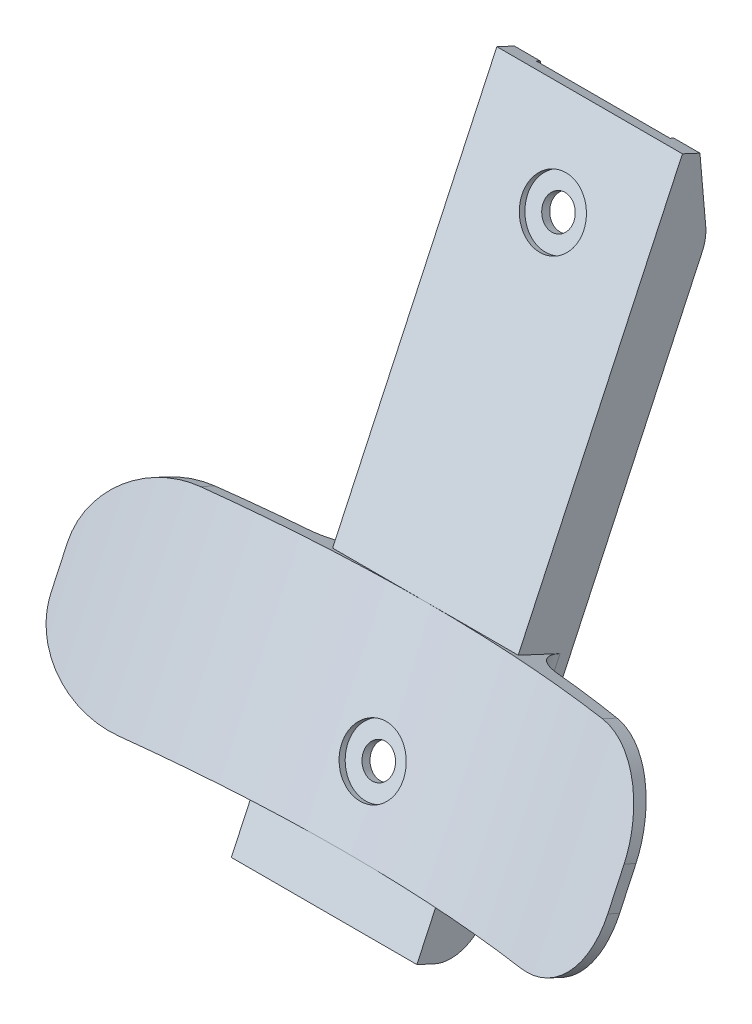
ISO-10303-21;
HEADER;
FILE_DESCRIPTION(('STEP AP214'),'2;1');
FILE_NAME('part.step','',(''),(''),'','','');
FILE_SCHEMA(('AUTOMOTIVE_DESIGN { 1 0 10303 214 1 1 1 1 }'));
ENDSEC;
DATA;
#1=APPLICATION_CONTEXT('core data for automotive mechanical design processes');
#2=APPLICATION_PROTOCOL_DEFINITION('international standard','automotive_design',2000,#1);
#3=PRODUCT_CONTEXT('',#1,'mechanical');
#4=PRODUCT('Part','Part','',(#3));
#5=PRODUCT_RELATED_PRODUCT_CATEGORY('part','',(#4));
#6=PRODUCT_DEFINITION_FORMATION('','',#4);
#7=PRODUCT_DEFINITION_CONTEXT('part definition',#1,'design');
#8=PRODUCT_DEFINITION('design','',#6,#7);
#9=PRODUCT_DEFINITION_SHAPE('','',#8);
#10=(LENGTH_UNIT() NAMED_UNIT(*) SI_UNIT(.MILLI.,.METRE.));
#11=(NAMED_UNIT(*) PLANE_ANGLE_UNIT() SI_UNIT($,.RADIAN.));
#12=(NAMED_UNIT(*) SI_UNIT($,.STERADIAN.) SOLID_ANGLE_UNIT());
#13=UNCERTAINTY_MEASURE_WITH_UNIT(LENGTH_MEASURE(1.E-05),#10,'distance_accuracy_value','');
#14=(GEOMETRIC_REPRESENTATION_CONTEXT(3) GLOBAL_UNCERTAINTY_ASSIGNED_CONTEXT((#13)) GLOBAL_UNIT_ASSIGNED_CONTEXT((#10,
#11,#12)) REPRESENTATION_CONTEXT('',''));
#15=CARTESIAN_POINT('',(0.,0.,0.));
#16=DIRECTION('',(0.,0.,1.));
#17=DIRECTION('',(1.,0.,0.));
#18=AXIS2_PLACEMENT_3D('',#15,#16,#17);
#19=CARTESIAN_POINT('',(-4.064,52.9474545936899,23.4535409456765));
#20=DIRECTION('',(0.,-0.422618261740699,-0.90630778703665));
#21=DIRECTION('',(0.,0.90630778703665,-0.422618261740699));
#22=AXIS2_PLACEMENT_3D('',#19,#20,#21);
#23=CYLINDRICAL_SURFACE('',#22,1.27);
#24=CARTESIAN_POINT('',(-4.064,49.7405215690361,16.5762508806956));
#25=DIRECTION('',(0.,-0.422618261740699,-0.90630778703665));
#26=DIRECTION('',(0.,0.90630778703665,-0.422618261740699));
#27=AXIS2_PLACEMENT_3D('',#24,#25,#26);
#28=CIRCLE('',#27,1.27);
#29=CARTESIAN_POINT('',(-4.064,50.8915324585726,16.0395256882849));
#30=VERTEX_POINT('',#29);
#31=EDGE_CURVE('E229',#30,#30,#28,.T.);
#32=ORIENTED_EDGE('',*,*,#31,.T.);
#33=EDGE_LOOP('',(#32));
#34=FACE_BOUND('',#33,.T.);
#35=CARTESIAN_POINT('',(-4.064,50.0491385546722,17.2380821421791));
#36=DIRECTION('',(0.,-0.422618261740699,-0.90630778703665));
#37=DIRECTION('',(0.,0.90630778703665,-0.422618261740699));
#38=AXIS2_PLACEMENT_3D('',#35,#36,#37);
#39=CIRCLE('',#38,1.27);
#40=CARTESIAN_POINT('',(-4.064,51.2001494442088,16.7013569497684));
#41=VERTEX_POINT('',#40);
#42=EDGE_CURVE('E608',#41,#41,#39,.F.);
#43=ORIENTED_EDGE('',*,*,#42,.T.);
#44=EDGE_LOOP('',(#43));
#45=FACE_BOUND('',#44,.T.);
#46=ADVANCED_FACE('F17',(#34,#45),#23,.F.);
#47=CARTESIAN_POINT('',(-4.064,50.3123039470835,15.9242696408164));
#48=DIRECTION('',(-1.,0.,0.));
#49=DIRECTION('',(0.,0.,1.));
#50=AXIS2_PLACEMENT_3D('',#47,#48,#49);
#51=CYLINDRICAL_SURFACE('',#50,3.175);
#52=CARTESIAN_POINT('',(-9.5504,50.3123039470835,15.9242696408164));
#53=DIRECTION('',(-1.,0.,0.));
#54=DIRECTION('',(0.,0.,1.));
#55=AXIS2_PLACEMENT_3D('',#52,#53,#54);
#56=CIRCLE('',#55,3.175);
#57=CARTESIAN_POINT('',(-9.5504,50.5890234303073,12.7613514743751));
#58=VERTEX_POINT('',#57);
#59=CARTESIAN_POINT('',(-9.5504,48.9704909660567,13.046742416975));
#60=VERTEX_POINT('',#59);
#61=EDGE_CURVE('E265',#58,#60,#56,.T.);
#62=ORIENTED_EDGE('',*,*,#61,.T.);
#63=DIRECTION('',(1.,0.,0.));
#64=VECTOR('',#63,1.);
#65=CARTESIAN_POINT('',(-4.064,48.9704909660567,13.046742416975));
#66=LINE('',#65,#64);
#67=CARTESIAN_POINT('',(-11.684,48.9704909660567,13.046742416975));
#68=VERTEX_POINT('',#67);
#69=EDGE_CURVE('E253',#68,#60,#66,.T.);
#70=ORIENTED_EDGE('',*,*,#69,.F.);
#71=CARTESIAN_POINT('',(-11.684,50.3123039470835,15.9242696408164));
#72=DIRECTION('',(-1.,0.,0.));
#73=DIRECTION('',(0.,0.,1.));
#74=AXIS2_PLACEMENT_3D('',#71,#72,#73);
#75=CIRCLE('',#74,3.175);
#76=CARTESIAN_POINT('',(-11.684,50.5890234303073,12.7613514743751));
#77=VERTEX_POINT('',#76);
#78=EDGE_CURVE('E22',#68,#77,#75,.F.);
#79=ORIENTED_EDGE('',*,*,#78,.T.);
#80=DIRECTION('',(1.,0.,0.));
#81=VECTOR('',#80,1.);
#82=CARTESIAN_POINT('',(-4.064,50.5890234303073,12.7613514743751));
#83=LINE('',#82,#81);
#84=EDGE_CURVE('E248',#77,#58,#83,.T.);
#85=ORIENTED_EDGE('',*,*,#84,.T.);
#86=EDGE_LOOP('',(#62,#70,#79,#85));
#87=FACE_BOUND('',#86,.T.);
#88=ADVANCED_FACE('F437',(#87),#51,.T.);
#89=CARTESIAN_POINT('',(-9.5504,7.9657280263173,32.1675773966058));
#90=DIRECTION('',(-1.,0.,0.));
#91=DIRECTION('',(0.,0.,1.));
#92=AXIS2_PLACEMENT_3D('',#89,#90,#91);
#93=PLANE('',#92);
#94=ORIENTED_EDGE('',*,*,#61,.F.);
#95=DIRECTION('',(0.,-0.996194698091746,-0.0871557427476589));
#96=VECTOR('',#95,1.);
#97=CARTESIAN_POINT('',(-9.5504,56.0673583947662,13.2406436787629));
#98=LINE('',#97,#96);
#99=CARTESIAN_POINT('',(-9.5504,56.0673583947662,13.2406436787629));
#100=VERTEX_POINT('',#99);
#101=EDGE_CURVE('E251',#58,#100,#98,.F.);
#102=ORIENTED_EDGE('',*,*,#101,.T.);
#103=DIRECTION('',(0.,-0.422618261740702,-0.906307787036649));
#104=VECTOR('',#103,1.);
#105=CARTESIAN_POINT('',(-9.5504,56.2149578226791,13.5571716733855));
#106=LINE('',#105,#104);
#107=CARTESIAN_POINT('',(-9.5504,56.2149578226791,13.5571716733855));
#108=VERTEX_POINT('',#107);
#109=EDGE_CURVE('E219',#108,#100,#106,.T.);
#110=ORIENTED_EDGE('',*,*,#109,.F.);
#111=DIRECTION('',(0.,-0.90630778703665,0.422618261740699));
#112=VECTOR('',#111,1.);
#113=CARTESIAN_POINT('',(-9.5504,59.409013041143,12.0677592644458));
#114=LINE('',#113,#112);
#115=CARTESIAN_POINT('',(-9.5504,9.45514043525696,35.3616326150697));
#116=VERTEX_POINT('',#115);
#117=EDGE_CURVE('E222',#108,#116,#114,.T.);
#118=ORIENTED_EDGE('',*,*,#117,.T.);
#119=DIRECTION('',(0.,0.422618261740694,0.906307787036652));
#120=VECTOR('',#119,1.);
#121=CARTESIAN_POINT('',(-9.5504,9.30754100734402,35.0451046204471));
#122=LINE('',#121,#120);
#123=CARTESIAN_POINT('',(-9.5504,9.30754100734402,35.0451046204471));
#124=VERTEX_POINT('',#123);
#125=EDGE_CURVE('E207',#124,#116,#122,.T.);
#126=ORIENTED_EDGE('',*,*,#125,.F.);
#127=CARTESIAN_POINT('',(-9.5504,12.1850682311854,33.7032916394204));
#128=DIRECTION('',(1.,0.,0.));
#129=DIRECTION('',(0.,0.,-1.));
#130=AXIS2_PLACEMENT_3D('',#127,#128,#129);
#131=CIRCLE('',#130,3.175);
#132=CARTESIAN_POINT('',(-9.5504,10.8432552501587,30.825764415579));
#133=VERTEX_POINT('',#132);
#134=EDGE_CURVE('E569',#133,#124,#131,.F.);
#135=ORIENTED_EDGE('',*,*,#134,.F.);
#136=DIRECTION('',(0.,0.90630778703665,-0.422618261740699));
#137=VECTOR('',#136,1.);
#138=CARTESIAN_POINT('',(-9.5504,31.3456367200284,21.2653469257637));
#139=LINE('',#138,#137);
#140=EDGE_CURVE('E261',#60,#133,#139,.F.);
#141=ORIENTED_EDGE('',*,*,#140,.F.);
#142=EDGE_LOOP('',(#94,#102,#110,#118,#126,#135,#141));
#143=FACE_BOUND('',#142,.T.);
#144=ADVANCED_FACE('F223',(#143),#93,.F.);
#145=CARTESIAN_POINT('',(-4.064,50.0491385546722,17.2380821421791));
#146=DIRECTION('',(0.,-0.422618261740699,-0.90630778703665));
#147=DIRECTION('',(0.,0.90630778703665,-0.422618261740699));
#148=AXIS2_PLACEMENT_3D('',#145,#146,#147);
#149=PLANE('',#148);
#150=ORIENTED_EDGE('',*,*,#42,.F.);
#151=EDGE_LOOP('',(#150));
#152=FACE_BOUND('',#151,.T.);
#153=CARTESIAN_POINT('',(-4.064,50.0491385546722,17.2380821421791));
#154=DIRECTION('',(0.,-0.422618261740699,-0.90630778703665));
#155=DIRECTION('',(0.,0.90630778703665,-0.422618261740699));
#156=AXIS2_PLACEMENT_3D('',#153,#154,#155);
#157=CIRCLE('',#156,2.54);
#158=CARTESIAN_POINT('',(-4.064,52.3511603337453,16.1646317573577));
#159=VERTEX_POINT('',#158);
#160=EDGE_CURVE('E558',#159,#159,#157,.F.);
#161=ORIENTED_EDGE('',*,*,#160,.T.);
#162=EDGE_LOOP('',(#161));
#163=FACE_BOUND('',#162,.T.);
#164=ADVANCED_FACE('F430',(#152,#163),#149,.F.);
#165=CARTESIAN_POINT('',(-4.064,50.3123039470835,15.9242696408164));
#166=DIRECTION('',(-1.,0.,0.));
#167=DIRECTION('',(0.,0.,1.));
#168=AXIS2_PLACEMENT_3D('',#165,#166,#167);
#169=CYLINDRICAL_SURFACE('',#168,3.175);
#170=CARTESIAN_POINT('',(3.556,50.3123039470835,15.9242696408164));
#171=DIRECTION('',(-1.,0.,0.));
#172=DIRECTION('',(0.,0.,1.));
#173=AXIS2_PLACEMENT_3D('',#170,#171,#172);
#174=CIRCLE('',#173,3.175);
#175=CARTESIAN_POINT('',(3.556,50.5890234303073,12.7613514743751));
#176=VERTEX_POINT('',#175);
#177=CARTESIAN_POINT('',(3.556,48.9704909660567,13.046742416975));
#178=VERTEX_POINT('',#177);
#179=EDGE_CURVE('E606',#176,#178,#174,.T.);
#180=ORIENTED_EDGE('',*,*,#179,.T.);
#181=DIRECTION('',(1.,0.,0.));
#182=VECTOR('',#181,1.);
#183=CARTESIAN_POINT('',(-4.064,48.9704909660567,13.046742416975));
#184=LINE('',#183,#182);
#185=CARTESIAN_POINT('',(1.4224,48.9704909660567,13.046742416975));
#186=VERTEX_POINT('',#185);
#187=EDGE_CURVE('E237',#186,#178,#184,.T.);
#188=ORIENTED_EDGE('',*,*,#187,.F.);
#189=CARTESIAN_POINT('',(1.4224,50.3123039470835,15.9242696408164));
#190=DIRECTION('',(-1.,0.,0.));
#191=DIRECTION('',(0.,0.,1.));
#192=AXIS2_PLACEMENT_3D('',#189,#190,#191);
#193=CIRCLE('',#192,3.175);
#194=CARTESIAN_POINT('',(1.4224,50.5890234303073,12.7613514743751));
#195=VERTEX_POINT('',#194);
#196=EDGE_CURVE('E604',#186,#195,#193,.F.);
#197=ORIENTED_EDGE('',*,*,#196,.T.);
#198=DIRECTION('',(1.,0.,0.));
#199=VECTOR('',#198,1.);
#200=CARTESIAN_POINT('',(-4.064,50.5890234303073,12.7613514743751));
#201=LINE('',#200,#199);
#202=EDGE_CURVE('E540',#195,#176,#201,.T.);
#203=ORIENTED_EDGE('',*,*,#202,.T.);
#204=EDGE_LOOP('',(#180,#188,#197,#203));
#205=FACE_BOUND('',#204,.T.);
#206=ADVANCED_FACE('F426',(#205),#169,.T.);
#207=CARTESIAN_POINT('',(1.4224,57.9196006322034,8.8737040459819));
#208=DIRECTION('',(1.,0.,0.));
#209=DIRECTION('',(0.,0.,-1.));
#210=AXIS2_PLACEMENT_3D('',#207,#208,#209);
#211=PLANE('',#210);
#212=ORIENTED_EDGE('',*,*,#196,.F.);
#213=DIRECTION('',(0.,0.90630778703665,-0.422618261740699));
#214=VECTOR('',#213,1.);
#215=CARTESIAN_POINT('',(1.4224,31.3456367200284,21.2653469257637));
#216=LINE('',#215,#214);
#217=CARTESIAN_POINT('',(1.4224,10.8432552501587,30.825764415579));
#218=VERTEX_POINT('',#217);
#219=EDGE_CURVE('E234',#218,#186,#216,.T.);
#220=ORIENTED_EDGE('',*,*,#219,.F.);
#221=CARTESIAN_POINT('',(1.4224,12.1850682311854,33.7032916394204));
#222=DIRECTION('',(1.,0.,0.));
#223=DIRECTION('',(0.,0.,-1.));
#224=AXIS2_PLACEMENT_3D('',#221,#222,#223);
#225=CIRCLE('',#224,3.175);
#226=CARTESIAN_POINT('',(1.4224,9.30754100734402,35.0451046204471));
#227=VERTEX_POINT('',#226);
#228=EDGE_CURVE('E527',#227,#218,#225,.T.);
#229=ORIENTED_EDGE('',*,*,#228,.F.);
#230=DIRECTION('',(0.,-0.422618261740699,-0.90630778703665));
#231=VECTOR('',#230,1.);
#232=CARTESIAN_POINT('',(1.4224,7.9657280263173,32.1675773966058));
#233=LINE('',#232,#231);
#234=CARTESIAN_POINT('',(1.4224,9.45514043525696,35.3616326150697));
#235=VERTEX_POINT('',#234);
#236=EDGE_CURVE('E553',#235,#227,#233,.T.);
#237=ORIENTED_EDGE('',*,*,#236,.F.);
#238=DIRECTION('',(0.,-0.90630778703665,0.422618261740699));
#239=VECTOR('',#238,1.);
#240=CARTESIAN_POINT('',(1.4224,59.409013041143,12.0677592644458));
#241=LINE('',#240,#239);
#242=CARTESIAN_POINT('',(1.4224,56.2149578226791,13.5571716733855));
#243=VERTEX_POINT('',#242);
#244=EDGE_CURVE('E228',#235,#243,#241,.F.);
#245=ORIENTED_EDGE('',*,*,#244,.T.);
#246=DIRECTION('',(0.,0.422618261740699,0.90630778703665));
#247=VECTOR('',#246,1.);
#248=CARTESIAN_POINT('',(1.4224,54.7255454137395,10.3631164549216));
#249=LINE('',#248,#247);
#250=CARTESIAN_POINT('',(1.4224,56.0673583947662,13.2406436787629));
#251=VERTEX_POINT('',#250);
#252=EDGE_CURVE('E258',#251,#243,#249,.T.);
#253=ORIENTED_EDGE('',*,*,#252,.F.);
#254=DIRECTION('',(0.,-0.996194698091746,-0.0871557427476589));
#255=VECTOR('',#254,1.);
#256=CARTESIAN_POINT('',(1.4224,56.0673583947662,13.2406436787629));
#257=LINE('',#256,#255);
#258=EDGE_CURVE('E543',#251,#195,#257,.T.);
#259=ORIENTED_EDGE('',*,*,#258,.T.);
#260=EDGE_LOOP('',(#212,#220,#229,#237,#245,#253,#259));
#261=FACE_BOUND('',#260,.T.);
#262=ADVANCED_FACE('F423',(#261),#211,.F.);
#263=CARTESIAN_POINT('',(-9.5504,59.409013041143,12.0677592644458));
#264=DIRECTION('',(0.,0.422618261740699,0.90630778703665));
#265=DIRECTION('',(0.,-0.90630778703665,0.422618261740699));
#266=AXIS2_PLACEMENT_3D('',#263,#264,#265);
#267=PLANE('',#266);
#268=ORIENTED_EDGE('',*,*,#244,.F.);
#269=DIRECTION('',(1.,0.,0.));
#270=VECTOR('',#269,1.);
#271=CARTESIAN_POINT('',(-4.064,9.45514043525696,35.3616326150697));
#272=LINE('',#271,#270);
#273=EDGE_CURVE('E211',#116,#235,#272,.T.);
#274=ORIENTED_EDGE('',*,*,#273,.F.);
#275=ORIENTED_EDGE('',*,*,#117,.F.);
#276=DIRECTION('',(1.,0.,0.));
#277=VECTOR('',#276,1.);
#278=CARTESIAN_POINT('',(-4.064,56.2149578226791,13.5571716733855));
#279=LINE('',#278,#277);
#280=EDGE_CURVE('E256',#243,#108,#279,.F.);
#281=ORIENTED_EDGE('',*,*,#280,.F.);
#282=EDGE_LOOP('',(#268,#274,#275,#281));
#283=FACE_BOUND('',#282,.T.);
#284=CARTESIAN_POINT('',(-4.064,18.0877221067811,31.3361936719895));
#285=DIRECTION('',(0.,-0.422618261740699,-0.90630778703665));
#286=DIRECTION('',(0.,0.90630778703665,-0.422618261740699));
#287=AXIS2_PLACEMENT_3D('',#284,#285,#286);
#288=CIRCLE('',#287,1.27);
#289=CARTESIAN_POINT('',(-4.064,19.2387329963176,30.7994684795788));
#290=VERTEX_POINT('',#289);
#291=EDGE_CURVE('E530',#290,#290,#288,.F.);
#292=ORIENTED_EDGE('',*,*,#291,.T.);
#293=EDGE_LOOP('',(#292));
#294=FACE_BOUND('',#293,.T.);
#295=ORIENTED_EDGE('',*,*,#31,.F.);
#296=EDGE_LOOP('',(#295));
#297=FACE_BOUND('',#296,.T.);
#298=ADVANCED_FACE('F231',(#283,#294,#297),#267,.F.);
#299=CARTESIAN_POINT('',(-4.064,56.0673583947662,13.2406436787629));
#300=DIRECTION('',(0.,-0.0871557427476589,0.996194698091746));
#301=DIRECTION('',(0.,-0.996194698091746,-0.0871557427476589));
#302=AXIS2_PLACEMENT_3D('',#299,#300,#301);
#303=PLANE('',#302);
#304=ORIENTED_EDGE('',*,*,#84,.F.);
#305=DIRECTION('',(0.,-0.996194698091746,-0.0871557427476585));
#306=VECTOR('',#305,1.);
#307=CARTESIAN_POINT('',(-11.684,56.0673583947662,13.2406436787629));
#308=LINE('',#307,#306);
#309=CARTESIAN_POINT('',(-11.684,56.0673583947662,13.2406436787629));
#310=VERTEX_POINT('',#309);
#311=EDGE_CURVE('E598',#310,#77,#308,.T.);
#312=ORIENTED_EDGE('',*,*,#311,.F.);
#313=DIRECTION('',(1.,0.,0.));
#314=VECTOR('',#313,1.);
#315=CARTESIAN_POINT('',(-4.064,56.0673583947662,13.2406436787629));
#316=LINE('',#315,#314);
#317=EDGE_CURVE('E183',#100,#310,#316,.F.);
#318=ORIENTED_EDGE('',*,*,#317,.F.);
#319=ORIENTED_EDGE('',*,*,#101,.F.);
#320=EDGE_LOOP('',(#304,#312,#318,#319));
#321=FACE_BOUND('',#320,.T.);
#322=ADVANCED_FACE('F416',(#321),#303,.F.);
#323=CARTESIAN_POINT('',(-4.064,31.3456367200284,21.2653469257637));
#324=DIRECTION('',(0.,-0.422618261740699,-0.90630778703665));
#325=DIRECTION('',(0.,0.90630778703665,-0.422618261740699));
#326=AXIS2_PLACEMENT_3D('',#323,#324,#325);
#327=PLANE('',#326);
#328=ORIENTED_EDGE('',*,*,#140,.T.);
#329=DIRECTION('',(1.,0.,0.));
#330=VECTOR('',#329,1.);
#331=CARTESIAN_POINT('',(-4.064,10.8432552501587,30.825764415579));
#332=LINE('',#331,#330);
#333=CARTESIAN_POINT('',(-11.684,10.8432552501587,30.825764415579));
#334=VERTEX_POINT('',#333);
#335=EDGE_CURVE('E263',#334,#133,#332,.T.);
#336=ORIENTED_EDGE('',*,*,#335,.F.);
#337=DIRECTION('',(0.,-0.90630778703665,0.422618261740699));
#338=VECTOR('',#337,1.);
#339=CARTESIAN_POINT('',(-11.684,48.9704909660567,13.046742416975));
#340=LINE('',#339,#338);
#341=EDGE_CURVE('E595',#68,#334,#340,.T.);
#342=ORIENTED_EDGE('',*,*,#341,.F.);
#343=ORIENTED_EDGE('',*,*,#69,.T.);
#344=EDGE_LOOP('',(#328,#336,#342,#343));
#345=FACE_BOUND('',#344,.T.);
#346=ADVANCED_FACE('F412',(#345),#327,.T.);
#347=CARTESIAN_POINT('',(-4.064,12.1850682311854,33.7032916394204));
#348=DIRECTION('',(1.,0.,0.));
#349=DIRECTION('',(0.,0.,-1.));
#350=AXIS2_PLACEMENT_3D('',#347,#348,#349);
#351=CYLINDRICAL_SURFACE('',#350,3.175);
#352=ORIENTED_EDGE('',*,*,#134,.T.);
#353=DIRECTION('',(1.,0.,0.));
#354=VECTOR('',#353,1.);
#355=CARTESIAN_POINT('',(-4.064,9.30754100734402,35.0451046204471));
#356=LINE('',#355,#354);
#357=CARTESIAN_POINT('',(-11.684,9.30754100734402,35.0451046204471));
#358=VERTEX_POINT('',#357);
#359=EDGE_CURVE('E215',#358,#124,#356,.T.);
#360=ORIENTED_EDGE('',*,*,#359,.F.);
#361=CARTESIAN_POINT('',(-11.684,12.1850682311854,33.7032916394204));
#362=DIRECTION('',(1.,0.,0.));
#363=DIRECTION('',(0.,0.,-1.));
#364=AXIS2_PLACEMENT_3D('',#361,#362,#363);
#365=CIRCLE('',#364,3.175);
#366=EDGE_CURVE('E593',#334,#358,#365,.F.);
#367=ORIENTED_EDGE('',*,*,#366,.F.);
#368=ORIENTED_EDGE('',*,*,#335,.T.);
#369=EDGE_LOOP('',(#352,#360,#367,#368));
#370=FACE_BOUND('',#369,.T.);
#371=ADVANCED_FACE('F408',(#370),#351,.T.);
#372=CARTESIAN_POINT('',(-4.064,50.2638286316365,17.6984864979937));
#373=DIRECTION('',(0.,-0.422618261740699,-0.90630778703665));
#374=DIRECTION('',(0.,0.90630778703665,-0.422618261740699));
#375=AXIS2_PLACEMENT_3D('',#372,#373,#374);
#376=CYLINDRICAL_SURFACE('',#375,2.54);
#377=ORIENTED_EDGE('',*,*,#160,.F.);
#378=EDGE_LOOP('',(#377));
#379=FACE_BOUND('',#378,.T.);
#380=CARTESIAN_POINT('',(-4.064,50.2638286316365,17.6984864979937));
#381=DIRECTION('',(0.,-0.422618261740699,-0.90630778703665));
#382=DIRECTION('',(0.,0.90630778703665,-0.422618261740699));
#383=AXIS2_PLACEMENT_3D('',#380,#381,#382);
#384=CIRCLE('',#383,2.54);
#385=CARTESIAN_POINT('',(-4.064,52.5658504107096,16.6250361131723));
#386=VERTEX_POINT('',#385);
#387=EDGE_CURVE('E505',#386,#386,#384,.T.);
#388=ORIENTED_EDGE('',*,*,#387,.F.);
#389=EDGE_LOOP('',(#388));
#390=FACE_BOUND('',#389,.T.);
#391=ADVANCED_FACE('F405',(#379,#390),#376,.F.);
#392=CARTESIAN_POINT('',(-4.064,54.7255454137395,10.3631164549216));
#393=DIRECTION('',(0.,0.90630778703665,-0.422618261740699));
#394=DIRECTION('',(0.,0.422618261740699,0.90630778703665));
#395=AXIS2_PLACEMENT_3D('',#392,#393,#394);
#396=PLANE('',#395);
#397=DIRECTION('',(0.,-0.4226182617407,-0.90630778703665));
#398=VECTOR('',#397,1.);
#399=CARTESIAN_POINT('',(-11.684,56.7382648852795,14.6794072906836));
#400=LINE('',#399,#398);
#401=CARTESIAN_POINT('',(-11.684,56.7382648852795,14.6794072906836));
#402=VERTEX_POINT('',#401);
#403=EDGE_CURVE('E506',#402,#310,#400,.T.);
#404=ORIENTED_EDGE('',*,*,#403,.F.);
#405=DIRECTION('',(1.,0.,0.));
#406=VECTOR('',#405,1.);
#407=CARTESIAN_POINT('',(-4.064,56.7382648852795,14.6794072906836));
#408=LINE('',#407,#406);
#409=CARTESIAN_POINT('',(3.556,56.7382648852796,14.6794072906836));
#410=VERTEX_POINT('',#409);
#411=EDGE_CURVE('E510',#410,#402,#408,.F.);
#412=ORIENTED_EDGE('',*,*,#411,.F.);
#413=DIRECTION('',(0.,0.422618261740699,0.90630778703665));
#414=VECTOR('',#413,1.);
#415=CARTESIAN_POINT('',(3.556,54.7255454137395,10.3631164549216));
#416=LINE('',#415,#414);
#417=CARTESIAN_POINT('',(3.556,56.0673583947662,13.2406436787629));
#418=VERTEX_POINT('',#417);
#419=EDGE_CURVE('E556',#410,#418,#416,.F.);
#420=ORIENTED_EDGE('',*,*,#419,.T.);
#421=DIRECTION('',(1.,0.,0.));
#422=VECTOR('',#421,1.);
#423=CARTESIAN_POINT('',(-4.064,56.0673583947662,13.2406436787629));
#424=LINE('',#423,#422);
#425=EDGE_CURVE('E544',#418,#251,#424,.F.);
#426=ORIENTED_EDGE('',*,*,#425,.T.);
#427=ORIENTED_EDGE('',*,*,#252,.T.);
#428=ORIENTED_EDGE('',*,*,#280,.T.);
#429=ORIENTED_EDGE('',*,*,#109,.T.);
#430=ORIENTED_EDGE('',*,*,#317,.T.);
#431=EDGE_LOOP('',(#404,#412,#420,#426,#427,#428,#429,#430));
#432=FACE_BOUND('',#431,.T.);
#433=ADVANCED_FACE('F402',(#432),#396,.T.);
#434=CARTESIAN_POINT('',(-4.064,7.9657280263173,32.1675773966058));
#435=DIRECTION('',(0.,-0.90630778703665,0.422618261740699));
#436=DIRECTION('',(0.,-0.422618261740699,-0.90630778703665));
#437=AXIS2_PLACEMENT_3D('',#434,#435,#436);
#438=PLANE('',#437);
#439=ORIENTED_EDGE('',*,*,#125,.T.);
#440=ORIENTED_EDGE('',*,*,#273,.T.);
#441=ORIENTED_EDGE('',*,*,#236,.T.);
#442=DIRECTION('',(1.,0.,0.));
#443=VECTOR('',#442,1.);
#444=CARTESIAN_POINT('',(-4.064,9.30754100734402,35.0451046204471));
#445=LINE('',#444,#443);
#446=CARTESIAN_POINT('',(3.556,9.30754100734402,35.0451046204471));
#447=VERTEX_POINT('',#446);
#448=EDGE_CURVE('E526',#447,#227,#445,.F.);
#449=ORIENTED_EDGE('',*,*,#448,.F.);
#450=DIRECTION('',(0.,-0.422618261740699,-0.90630778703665));
#451=VECTOR('',#450,1.);
#452=CARTESIAN_POINT('',(3.556,7.9657280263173,32.1675773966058));
#453=LINE('',#452,#451);
#454=CARTESIAN_POINT('',(3.556,9.97844749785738,36.4838682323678));
#455=VERTEX_POINT('',#454);
#456=EDGE_CURVE('E239',#447,#455,#453,.F.);
#457=ORIENTED_EDGE('',*,*,#456,.T.);
#458=DIRECTION('',(1.,0.,0.));
#459=VECTOR('',#458,1.);
#460=CARTESIAN_POINT('',(-4.064,9.97844749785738,36.4838682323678));
#461=LINE('',#460,#459);
#462=CARTESIAN_POINT('',(-11.684,9.97844749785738,36.4838682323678));
#463=VERTEX_POINT('',#462);
#464=EDGE_CURVE('E521',#463,#455,#461,.T.);
#465=ORIENTED_EDGE('',*,*,#464,.F.);
#466=DIRECTION('',(0.,0.422618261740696,0.906307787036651));
#467=VECTOR('',#466,1.);
#468=CARTESIAN_POINT('',(-11.684,9.30754100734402,35.0451046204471));
#469=LINE('',#468,#467);
#470=EDGE_CURVE('E515',#358,#463,#469,.T.);
#471=ORIENTED_EDGE('',*,*,#470,.F.);
#472=ORIENTED_EDGE('',*,*,#359,.T.);
#473=EDGE_LOOP('',(#439,#440,#441,#449,#457,#465,#471,#472));
#474=FACE_BOUND('',#473,.T.);
#475=ADVANCED_FACE('F209',(#474),#438,.T.);
#476=CARTESIAN_POINT('',(-4.064,31.3456367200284,21.2653469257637));
#477=DIRECTION('',(0.,-0.422618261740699,-0.90630778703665));
#478=DIRECTION('',(0.,0.90630778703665,-0.422618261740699));
#479=AXIS2_PLACEMENT_3D('',#476,#477,#478);
#480=PLANE('',#479);
#481=DIRECTION('',(0.,0.90630778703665,-0.422618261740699));
#482=VECTOR('',#481,1.);
#483=CARTESIAN_POINT('',(3.556,10.8432552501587,30.825764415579));
#484=LINE('',#483,#482);
#485=CARTESIAN_POINT('',(3.556,10.8432552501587,30.825764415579));
#486=VERTEX_POINT('',#485);
#487=EDGE_CURVE('E533',#486,#178,#484,.T.);
#488=ORIENTED_EDGE('',*,*,#487,.F.);
#489=DIRECTION('',(1.,0.,0.));
#490=VECTOR('',#489,1.);
#491=CARTESIAN_POINT('',(-4.064,10.8432552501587,30.825764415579));
#492=LINE('',#491,#490);
#493=EDGE_CURVE('E524',#218,#486,#492,.T.);
#494=ORIENTED_EDGE('',*,*,#493,.F.);
#495=ORIENTED_EDGE('',*,*,#219,.T.);
#496=ORIENTED_EDGE('',*,*,#187,.T.);
#497=EDGE_LOOP('',(#488,#494,#495,#496));
#498=FACE_BOUND('',#497,.T.);
#499=ADVANCED_FACE('F395',(#498),#480,.T.);
#500=CARTESIAN_POINT('',(-4.064,56.0673583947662,13.2406436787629));
#501=DIRECTION('',(0.,-0.0871557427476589,0.996194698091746));
#502=DIRECTION('',(0.,-0.996194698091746,-0.0871557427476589));
#503=AXIS2_PLACEMENT_3D('',#500,#501,#502);
#504=PLANE('',#503);
#505=ORIENTED_EDGE('',*,*,#202,.F.);
#506=ORIENTED_EDGE('',*,*,#258,.F.);
#507=ORIENTED_EDGE('',*,*,#425,.F.);
#508=DIRECTION('',(0.,0.996194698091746,0.0871557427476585));
#509=VECTOR('',#508,1.);
#510=CARTESIAN_POINT('',(3.556,50.5890234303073,12.7613514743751));
#511=LINE('',#510,#509);
#512=EDGE_CURVE('E500',#176,#418,#511,.T.);
#513=ORIENTED_EDGE('',*,*,#512,.F.);
#514=EDGE_LOOP('',(#505,#506,#507,#513));
#515=FACE_BOUND('',#514,.T.);
#516=ADVANCED_FACE('F391',(#515),#504,.F.);
#517=CARTESIAN_POINT('',(-4.064,12.1850682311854,33.7032916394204));
#518=DIRECTION('',(1.,0.,0.));
#519=DIRECTION('',(0.,0.,-1.));
#520=AXIS2_PLACEMENT_3D('',#517,#518,#519);
#521=CYLINDRICAL_SURFACE('',#520,3.175);
#522=CARTESIAN_POINT('',(3.556,12.1850682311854,33.7032916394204));
#523=DIRECTION('',(1.,0.,0.));
#524=DIRECTION('',(0.,0.,-1.));
#525=AXIS2_PLACEMENT_3D('',#522,#523,#524);
#526=CIRCLE('',#525,3.175);
#527=EDGE_CURVE('E489',#447,#486,#526,.T.);
#528=ORIENTED_EDGE('',*,*,#527,.F.);
#529=ORIENTED_EDGE('',*,*,#448,.T.);
#530=ORIENTED_EDGE('',*,*,#228,.T.);
#531=ORIENTED_EDGE('',*,*,#493,.T.);
#532=EDGE_LOOP('',(#528,#529,#530,#531));
#533=FACE_BOUND('',#532,.T.);
#534=ADVANCED_FACE('F387',(#533),#521,.T.);
#535=CARTESIAN_POINT('',(-4.064,21.2946551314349,38.2134837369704));
#536=DIRECTION('',(0.,-0.422618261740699,-0.90630778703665));
#537=DIRECTION('',(0.,0.90630778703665,-0.422618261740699));
#538=AXIS2_PLACEMENT_3D('',#535,#536,#537);
#539=CYLINDRICAL_SURFACE('',#538,1.27);
#540=ORIENTED_EDGE('',*,*,#291,.F.);
#541=EDGE_LOOP('',(#540));
#542=FACE_BOUND('',#541,.T.);
#543=CARTESIAN_POINT('',(-4.064,18.3963390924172,31.998024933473));
#544=DIRECTION('',(0.,-0.422618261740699,-0.90630778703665));
#545=DIRECTION('',(0.,0.90630778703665,-0.422618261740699));
#546=AXIS2_PLACEMENT_3D('',#543,#544,#545);
#547=CIRCLE('',#546,1.27);
#548=CARTESIAN_POINT('',(-4.064,19.5473499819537,31.4612997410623));
#549=VERTEX_POINT('',#548);
#550=EDGE_CURVE('E486',#549,#549,#547,.F.);
#551=ORIENTED_EDGE('',*,*,#550,.T.);
#552=EDGE_LOOP('',(#551));
#553=FACE_BOUND('',#552,.T.);
#554=ADVANCED_FACE('F383',(#542,#553),#539,.F.);
#555=CARTESIAN_POINT('',(-14.859,26.2179116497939,24.7308333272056));
#556=DIRECTION('',(0.,-0.90630778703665,0.422618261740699));
#557=DIRECTION('',(0.,-0.422618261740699,-0.90630778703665));
#558=AXIS2_PLACEMENT_3D('',#555,#556,#557);
#559=CYLINDRICAL_SURFACE('',#558,3.175);
#560=CARTESIAN_POINT('',(-14.859,26.2179116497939,24.7308333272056));
#561=DIRECTION('',(0.,-0.90630778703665,0.422618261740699));
#562=DIRECTION('',(0.,-0.422618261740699,-0.90630778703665));
#563=AXIS2_PLACEMENT_3D('',#560,#561,#562);
#564=CIRCLE('',#563,3.175);
#565=CARTESIAN_POINT('',(-14.2908421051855,27.5380659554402,27.5619133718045));
#566=VERTEX_POINT('',#565);
#567=CARTESIAN_POINT('',(-11.684,26.2179116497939,24.7308333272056));
#568=VERTEX_POINT('',#567);
#569=EDGE_CURVE('E643',#566,#568,#564,.F.);
#570=ORIENTED_EDGE('',*,*,#569,.T.);
#571=DIRECTION('',(0.,0.90630778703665,-0.422618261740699));
#572=VECTOR('',#571,1.);
#573=CARTESIAN_POINT('',(-11.684,11.8302755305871,31.4398982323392));
#574=LINE('',#573,#572);
#575=CARTESIAN_POINT('',(-11.684,11.8302755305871,31.4398982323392));
#576=VERTEX_POINT('',#575);
#577=EDGE_CURVE('E513',#576,#568,#574,.T.);
#578=ORIENTED_EDGE('',*,*,#577,.F.);
#579=CARTESIAN_POINT('',(-14.859,11.8302755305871,31.4398982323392));
#580=DIRECTION('',(0.,-0.90630778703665,0.422618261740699));
#581=DIRECTION('',(0.,-0.422618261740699,-0.90630778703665));
#582=AXIS2_PLACEMENT_3D('',#579,#580,#581);
#583=CIRCLE('',#582,3.175);
#584=CARTESIAN_POINT('',(-14.2908421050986,13.1504298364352,34.270978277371));
#585=VERTEX_POINT('',#584);
#586=EDGE_CURVE('E369',#585,#576,#583,.F.);
#587=ORIENTED_EDGE('',*,*,#586,.F.);
#588=DIRECTION('',(0.,-0.90630778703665,0.422618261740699));
#589=VECTOR('',#588,1.);
#590=CARTESIAN_POINT('',(-14.2908421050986,27.538065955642,27.5619133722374));
#591=LINE('',#590,#589);
#592=EDGE_CURVE('E503',#566,#585,#591,.T.);
#593=ORIENTED_EDGE('',*,*,#592,.F.);
#594=EDGE_LOOP('',(#570,#578,#587,#593));
#595=FACE_BOUND('',#594,.T.);
#596=ADVANCED_FACE('F380',(#595),#559,.F.);
#597=CARTESIAN_POINT('',(-11.684,31.3456367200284,21.2653469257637));
#598=DIRECTION('',(-1.,0.,0.));
#599=DIRECTION('',(0.,0.,1.));
#600=AXIS2_PLACEMENT_3D('',#597,#598,#599);
#601=PLANE('',#600);
#602=DIRECTION('',(0.,-0.90630778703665,0.422618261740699));
#603=VECTOR('',#602,1.);
#604=CARTESIAN_POINT('',(-11.684,33.3583561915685,25.5816377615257));
#605=LINE('',#604,#603);
#606=CARTESIAN_POINT('',(-11.684,27.8191162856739,28.1646277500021));
#607=VERTEX_POINT('',#606);
#608=EDGE_CURVE('E507',#402,#607,#605,.T.);
#609=ORIENTED_EDGE('',*,*,#608,.F.);
#610=ORIENTED_EDGE('',*,*,#403,.T.);
#611=ORIENTED_EDGE('',*,*,#311,.T.);
#612=ORIENTED_EDGE('',*,*,#78,.F.);
#613=ORIENTED_EDGE('',*,*,#341,.T.);
#614=ORIENTED_EDGE('',*,*,#366,.T.);
#615=ORIENTED_EDGE('',*,*,#470,.T.);
#616=DIRECTION('',(0.,-0.90630778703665,0.422618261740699));
#617=VECTOR('',#616,1.);
#618=CARTESIAN_POINT('',(-11.684,33.3583561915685,25.5816377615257));
#619=LINE('',#618,#617);
#620=CARTESIAN_POINT('',(-11.684,13.431480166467,34.8736926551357));
#621=VERTEX_POINT('',#620);
#622=EDGE_CURVE('E518',#621,#463,#619,.T.);
#623=ORIENTED_EDGE('',*,*,#622,.F.);
#624=DIRECTION('',(0.,-0.422618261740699,-0.90630778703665));
#625=VECTOR('',#624,1.);
#626=CARTESIAN_POINT('',(-11.684,40.2677397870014,92.424237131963));
#627=LINE('',#626,#625);
#628=EDGE_CURVE('E633',#576,#621,#627,.F.);
#629=ORIENTED_EDGE('',*,*,#628,.F.);
#630=ORIENTED_EDGE('',*,*,#577,.T.);
#631=DIRECTION('',(0.,-0.422618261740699,-0.90630778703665));
#632=VECTOR('',#631,1.);
#633=CARTESIAN_POINT('',(-11.684,54.6553759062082,85.7151722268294));
#634=LINE('',#633,#632);
#635=EDGE_CURVE('E651',#568,#607,#634,.F.);
#636=ORIENTED_EDGE('',*,*,#635,.T.);
#637=EDGE_LOOP('',(#609,#610,#611,#612,#613,#614,#615,#623,#629,#630,#636));
#638=FACE_BOUND('',#637,.T.);
#639=ADVANCED_FACE('F375',(#638),#601,.T.);
#640=CARTESIAN_POINT('',(-4.064,51.3008434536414,78.521354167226));
#641=DIRECTION('',(0.,-0.90630778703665,0.422618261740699));
#642=DIRECTION('',(0.,-0.422618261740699,-0.90630778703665));
#643=AXIS2_PLACEMENT_3D('',#640,#641,#642);
#644=CYLINDRICAL_SURFACE('',#643,57.15);
#645=CARTESIAN_POINT('',(-4.064,36.9132073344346,85.2304190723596));
#646=DIRECTION('',(0.,-0.90630778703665,0.422618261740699));
#647=DIRECTION('',(0.,-0.422618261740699,-0.90630778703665));
#648=AXIS2_PLACEMENT_3D('',#645,#646,#647);
#649=CIRCLE('',#648,57.15);
#650=CARTESIAN_POINT('',(-20.574,13.7903783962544,35.6433523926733));
#651=VERTEX_POINT('',#650);
#652=EDGE_CURVE('E792',#651,#585,#649,.T.);
#653=ORIENTED_EDGE('',*,*,#652,.F.);
#654=CARTESIAN_POINT('',(-26.924,20.5320073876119,35.0754423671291));
#655=CARTESIAN_POINT('',(-26.9240262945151,20.3790653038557,35.1467802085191));
#656=CARTESIAN_POINT('',(-26.9172735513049,20.2248765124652,35.2154209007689));
#657=CARTESIAN_POINT('',(-26.8904044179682,19.9152338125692,35.3468805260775));
#658=CARTESIAN_POINT('',(-26.8702915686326,19.7597802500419,35.4097009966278));
#659=CARTESIAN_POINT('',(-26.8169849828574,19.4492696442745,35.5289329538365));
#660=CARTESIAN_POINT('',(-26.78383483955,19.2942129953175,35.5853649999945));
#661=CARTESIAN_POINT('',(-26.7048100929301,18.9851357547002,35.6917905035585));
#662=CARTESIAN_POINT('',(-26.6589350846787,18.8311151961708,35.7417837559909));
#663=CARTESIAN_POINT('',(-26.5549639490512,18.5253549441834,35.8351180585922));
#664=CARTESIAN_POINT('',(-26.4968776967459,18.3736135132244,35.8784644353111));
#665=CARTESIAN_POINT('',(-26.3689906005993,18.073280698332,35.9584928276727));
#666=CARTESIAN_POINT('',(-26.2991853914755,17.9246905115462,35.9951723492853));
#667=CARTESIAN_POINT('',(-26.1484810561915,17.6316722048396,36.0618603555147));
#668=CARTESIAN_POINT('',(-26.0675800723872,17.4872447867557,36.0918677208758));
#669=CARTESIAN_POINT('',(-25.8953292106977,17.2034269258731,36.1452908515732));
#670=CARTESIAN_POINT('',(-25.8039753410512,17.0640384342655,36.1687040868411));
#671=CARTESIAN_POINT('',(-25.6076974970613,16.7857387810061,36.2098580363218));
#672=CARTESIAN_POINT('',(-25.5023783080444,16.6470671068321,36.2273360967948));
#673=CARTESIAN_POINT('',(-25.282004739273,16.3769317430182,36.2554901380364));
#674=CARTESIAN_POINT('',(-25.1669468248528,16.24547069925,36.2661636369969));
#675=CARTESIAN_POINT('',(-24.8083711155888,15.8631067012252,36.288292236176));
#676=CARTESIAN_POINT('',(-24.5513273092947,15.6240477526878,36.2898805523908));
#677=CARTESIAN_POINT('',(-23.987556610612,15.1667369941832,36.2678812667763));
#678=CARTESIAN_POINT('',(-23.6785455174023,14.9514101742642,36.2423876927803));
#679=CARTESIAN_POINT('',(-23.0347388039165,14.5693870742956,36.1657728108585));
#680=CARTESIAN_POINT('',(-22.6999456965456,14.4026860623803,36.1146539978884));
#681=CARTESIAN_POINT('',(-22.0680161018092,14.1449582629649,35.9992629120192));
#682=CARTESIAN_POINT('',(-21.7734410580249,14.0460860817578,35.938410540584));
#683=CARTESIAN_POINT('',(-21.3265356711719,13.9275755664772,35.8359407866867));
#684=CARTESIAN_POINT('',(-21.1767408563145,13.8930401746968,35.7999228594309));
#685=CARTESIAN_POINT('',(-20.8760427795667,13.8340773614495,35.7242946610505));
#686=CARTESIAN_POINT('',(-20.7251393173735,13.8096518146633,35.6846837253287));
#687=CARTESIAN_POINT('',(-20.574,13.7903783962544,35.6433523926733));
#688=B_SPLINE_CURVE_WITH_KNOTS('',3,(#654,#655,#656,#657,#658,#659,#660,#661,#662,#663,#664,
#665,#666,#667,#668,#669,#670,#671,#672,#673,#674,#675,#676,#677,#678,#679,#680,#681,#682,#683,
#684,#685,#686,#687),.UNSPECIFIED.,.F.,.F.,(4,2,2,2,2,2,2,2,2,2,2,2,2,2,2,2,4),(0.,
0.506107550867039,1.01208102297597,1.51637684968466,2.02068872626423,2.52459433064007,
3.02868805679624,3.53286628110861,4.03723768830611,4.56166968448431,5.08629284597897,
6.13489811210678,7.26251367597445,8.39001947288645,9.33686822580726,9.81020486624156,
10.2836292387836),.UNSPECIFIED.);
#689=CARTESIAN_POINT('',(-26.924,20.5320073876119,35.0754423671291));
#690=VERTEX_POINT('',#689);
#691=EDGE_CURVE('E356',#690,#651,#688,.T.);
#692=ORIENTED_EDGE('',*,*,#691,.F.);
#693=DIRECTION('',(0.,0.906307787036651,-0.422618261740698));
#694=VECTOR('',#693,1.);
#695=CARTESIAN_POINT('',(-26.924,20.5320073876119,35.0754423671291));
#696=LINE('',#695,#694);
#697=CARTESIAN_POINT('',(-26.924,23.4095346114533,33.7336293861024));
#698=VERTEX_POINT('',#697);
#699=EDGE_CURVE('E482',#690,#698,#696,.T.);
#700=ORIENTED_EDGE('',*,*,#699,.T.);
#701=CARTESIAN_POINT('',(-20.574,28.1780145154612,28.9342874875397));
#702=CARTESIAN_POINT('',(-20.7619865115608,28.2019964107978,28.9856829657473));
#703=CARTESIAN_POINT('',(-20.9496609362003,28.2188032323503,29.0415094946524));
#704=CARTESIAN_POINT('',(-21.3230520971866,28.2381056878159,29.1614774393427));
#705=CARTESIAN_POINT('',(-21.5087690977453,28.2406032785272,29.2256177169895));
#706=CARTESIAN_POINT('',(-21.8769018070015,28.2313343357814,29.3616573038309));
#707=CARTESIAN_POINT('',(-22.059318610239,28.2195726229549,29.4335539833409));
#708=CARTESIAN_POINT('',(-22.4196774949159,28.1818908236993,29.5845037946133));
#709=CARTESIAN_POINT('',(-22.5976194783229,28.15597042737,29.6635570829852));
#710=CARTESIAN_POINT('',(-22.9477995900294,28.0901054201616,29.828132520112));
#711=CARTESIAN_POINT('',(-23.1200383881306,28.050162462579,29.9136539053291));
#712=CARTESIAN_POINT('',(-23.4577212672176,27.9564000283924,30.0904697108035));
#713=CARTESIAN_POINT('',(-23.6231629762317,27.9025757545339,30.1817661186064));
#714=CARTESIAN_POINT('',(-23.9460098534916,27.781266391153,30.3692982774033));
#715=CARTESIAN_POINT('',(-24.1034163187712,27.7137835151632,30.4655332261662));
#716=CARTESIAN_POINT('',(-24.4090746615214,27.5653951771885,30.6621027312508));
#717=CARTESIAN_POINT('',(-24.5573268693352,27.4844901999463,30.7624371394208));
#718=CARTESIAN_POINT('',(-24.8432064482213,27.309758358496,30.9660572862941));
#719=CARTESIAN_POINT('',(-24.9808580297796,27.2159623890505,31.0693355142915));
#720=CARTESIAN_POINT('',(-25.2447391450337,27.0157105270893,31.2780596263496));
#721=CARTESIAN_POINT('',(-25.3709731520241,26.909259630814,31.3835046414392));
#722=CARTESIAN_POINT('',(-25.6109791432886,26.6841085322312,31.5955931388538));
#723=CARTESIAN_POINT('',(-25.7247483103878,26.5654055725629,31.7022368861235));
#724=CARTESIAN_POINT('',(-25.9386708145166,26.316368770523,31.9155974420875));
#725=CARTESIAN_POINT('',(-26.0388253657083,26.1860359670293,32.0223142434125));
#726=CARTESIAN_POINT('',(-26.2194082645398,25.9218633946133,32.2289065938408));
#727=CARTESIAN_POINT('',(-26.3006124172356,25.7885982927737,32.3288389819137));
#728=CARTESIAN_POINT('',(-26.4490335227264,25.5131273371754,32.5267355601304));
#729=CARTESIAN_POINT('',(-26.516252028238,25.3709224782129,32.6246999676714));
#730=CARTESIAN_POINT('',(-26.6358595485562,25.0787221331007,32.8175134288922));
#731=CARTESIAN_POINT('',(-26.6882701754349,24.9287383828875,32.9123668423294));
#732=CARTESIAN_POINT('',(-26.7777402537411,24.621964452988,33.0980751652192));
#733=CARTESIAN_POINT('',(-26.8148070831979,24.4651775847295,33.1889319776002));
#734=CARTESIAN_POINT('',(-26.8705679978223,24.1600985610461,33.3579317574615));
#735=CARTESIAN_POINT('',(-26.8905950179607,24.0122781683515,33.4364890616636));
#736=CARTESIAN_POINT('',(-26.9173149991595,23.7132348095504,33.5887926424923));
#737=CARTESIAN_POINT('',(-26.9240246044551,23.5620163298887,33.6625448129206));
#738=CARTESIAN_POINT('',(-26.924,23.4095346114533,33.7336293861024));
#739=B_SPLINE_CURVE_WITH_KNOTS('',3,(#701,#702,#703,#704,#705,#706,#707,#708,#709,#710,#711,
#712,#713,#714,#715,#716,#717,#718,#719,#720,#721,#722,#723,#724,#725,#726,#727,#728,#729,#730,
#731,#732,#733,#734,#735,#736,#737,#738),.UNSPECIFIED.,.F.,.F.,(4,2,2,2,2,2,2,2,2,2,2,2,2,2,2,2,
2,2,4),(0.,0.5888655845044,1.1776506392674,1.76623669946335,2.35483564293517,2.94336521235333,
3.53209844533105,4.12073634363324,4.70935298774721,5.29658277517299,5.88358148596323,
6.47071259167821,7.05779130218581,7.61299317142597,8.16813336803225,8.72245910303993,
9.27651798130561,9.78167090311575,10.2861920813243),.UNSPECIFIED.);
#740=CARTESIAN_POINT('',(-20.574,28.1780145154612,28.9342874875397));
#741=VERTEX_POINT('',#740);
#742=EDGE_CURVE('E364',#741,#698,#739,.T.);
#743=ORIENTED_EDGE('',*,*,#742,.F.);
#744=CARTESIAN_POINT('',(-4.064,51.3008434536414,78.521354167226));
#745=DIRECTION('',(0.,-0.90630778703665,0.422618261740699));
#746=DIRECTION('',(0.,-0.422618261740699,-0.90630778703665));
#747=AXIS2_PLACEMENT_3D('',#744,#745,#746);
#748=CIRCLE('',#747,57.15);
#749=EDGE_CURVE('E647',#741,#566,#748,.T.);
#750=ORIENTED_EDGE('',*,*,#749,.T.);
#751=ORIENTED_EDGE('',*,*,#592,.T.);
#752=EDGE_LOOP('',(#653,#692,#700,#743,#750,#751));
#753=FACE_BOUND('',#752,.T.);
#754=ADVANCED_FACE('F371',(#753),#644,.T.);
#755=CARTESIAN_POINT('',(-4.064,33.3583561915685,25.5816377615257));
#756=DIRECTION('',(0.,0.422618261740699,0.90630778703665));
#757=DIRECTION('',(0.,-0.90630778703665,0.422618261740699));
#758=AXIS2_PLACEMENT_3D('',#755,#756,#757);
#759=PLANE('',#758);
#760=DIRECTION('',(0.,-0.90630778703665,0.422618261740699));
#761=VECTOR('',#760,1.);
#762=CARTESIAN_POINT('',(3.556,56.7382648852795,14.6794072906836));
#763=LINE('',#762,#761);
#764=CARTESIAN_POINT('',(3.556,27.8191162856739,28.1646277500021));
#765=VERTEX_POINT('',#764);
#766=EDGE_CURVE('E493',#410,#765,#763,.T.);
#767=ORIENTED_EDGE('',*,*,#766,.F.);
#768=ORIENTED_EDGE('',*,*,#411,.T.);
#769=ORIENTED_EDGE('',*,*,#608,.T.);
#770=DIRECTION('',(1.,0.,0.));
#771=VECTOR('',#770,1.);
#772=CARTESIAN_POINT('',(-4.064,27.8191162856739,28.1646277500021));
#773=LINE('',#772,#771);
#774=CARTESIAN_POINT('',(-4.064,27.8191162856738,28.1646277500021));
#775=VERTEX_POINT('',#774);
#776=EDGE_CURVE('E648',#607,#775,#773,.T.);
#777=ORIENTED_EDGE('',*,*,#776,.T.);
#778=DIRECTION('',(1.,0.,0.));
#779=VECTOR('',#778,1.);
#780=CARTESIAN_POINT('',(-4.064,27.8191162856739,28.1646277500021));
#781=LINE('',#780,#779);
#782=EDGE_CURVE('E662',#775,#765,#781,.T.);
#783=ORIENTED_EDGE('',*,*,#782,.T.);
#784=EDGE_LOOP('',(#767,#768,#769,#777,#783));
#785=FACE_BOUND('',#784,.T.);
#786=ORIENTED_EDGE('',*,*,#387,.T.);
#787=EDGE_LOOP('',(#786));
#788=FACE_BOUND('',#787,.T.);
#789=ADVANCED_FACE('F317',(#785,#788),#759,.T.);
#790=CARTESIAN_POINT('',(-4.064,51.3008434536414,78.521354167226));
#791=DIRECTION('',(0.,-0.90630778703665,0.422618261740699));
#792=DIRECTION('',(0.,-0.422618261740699,-0.90630778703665));
#793=AXIS2_PLACEMENT_3D('',#790,#791,#792);
#794=CYLINDRICAL_SURFACE('',#793,57.15);
#795=CARTESIAN_POINT('',(-4.064,51.3008434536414,78.521354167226));
#796=DIRECTION('',(0.,-0.90630778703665,0.422618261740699));
#797=DIRECTION('',(0.,-0.422618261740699,-0.90630778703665));
#798=AXIS2_PLACEMENT_3D('',#795,#796,#797);
#799=CIRCLE('',#798,57.15);
#800=CARTESIAN_POINT('',(6.16284210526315,27.5380659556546,27.5619133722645));
#801=VERTEX_POINT('',#800);
#802=CARTESIAN_POINT('',(12.446,28.1780145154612,28.9342874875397));
#803=VERTEX_POINT('',#802);
#804=EDGE_CURVE('E689',#801,#803,#799,.T.);
#805=ORIENTED_EDGE('',*,*,#804,.T.);
#806=CARTESIAN_POINT('',(18.796,23.4095346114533,33.7336293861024));
#807=CARTESIAN_POINT('',(18.7960262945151,23.5624918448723,33.6623240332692));
#808=CARTESIAN_POINT('',(18.7892735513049,23.7141843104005,33.5883299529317));
#809=CARTESIAN_POINT('',(18.7624044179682,24.0139227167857,33.4356305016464));
#810=CARTESIAN_POINT('',(18.7422915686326,24.161969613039,33.3569263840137));
#811=CARTESIAN_POINT('',(18.6889849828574,24.4528989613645,33.1957022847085));
#812=CARTESIAN_POINT('',(18.65583483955,24.5957969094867,33.113195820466));
#813=CARTESIAN_POINT('',(18.5768100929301,24.875994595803,32.9448379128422));
#814=CARTESIAN_POINT('',(18.5309350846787,25.013294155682,32.8589863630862));
#815=CARTESIAN_POINT('',(18.4269639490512,25.2813312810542,32.6847545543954));
#816=CARTESIAN_POINT('',(18.3688776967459,25.4120740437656,32.596376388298));
#817=CARTESIAN_POINT('',(18.2409906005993,25.6664295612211,32.4177493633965));
#818=CARTESIAN_POINT('',(18.1711853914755,25.7900396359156,32.3274998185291));
#819=CARTESIAN_POINT('',(18.0204810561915,26.0294741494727,32.1459009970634));
#820=CARTESIAN_POINT('',(17.9395800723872,26.1452972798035,32.0545515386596));
#821=CARTESIAN_POINT('',(17.7673292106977,26.3686563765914,31.8714741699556));
#822=CARTESIAN_POINT('',(17.6759753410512,26.476189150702,31.7797461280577));
#823=CARTESIAN_POINT('',(17.4796974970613,26.6866024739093,31.5930094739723));
#824=CARTESIAN_POINT('',(17.3743783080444,26.7891278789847,31.4980154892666));
#825=CARTESIAN_POINT('',(17.154004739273,26.9843347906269,31.3091768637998));
#826=CARTESIAN_POINT('',(17.0389468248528,27.0770126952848,31.2153326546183));
#827=CARTESIAN_POINT('',(16.6803711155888,27.3397430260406,30.9366488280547));
#828=CARTESIAN_POINT('',(16.4233273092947,27.4946238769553,30.754539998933));
#829=CARTESIAN_POINT('',(15.859556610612,27.7717251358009,30.390078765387));
#830=CARTESIAN_POINT('',(15.5505455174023,27.8906053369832,30.2087418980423));
#831=CARTESIAN_POINT('',(14.9067388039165,28.0774746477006,29.8668481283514));
#832=CARTESIAN_POINT('',(14.5719456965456,28.1454687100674,29.7062892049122));
#833=CARTESIAN_POINT('',(13.9400161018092,28.2227382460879,29.4346862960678));
#834=CARTESIAN_POINT('',(13.6454410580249,28.2396764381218,29.3198306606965));
#835=CARTESIAN_POINT('',(13.1985356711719,28.237357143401,29.1631800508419));
#836=CARTESIAN_POINT('',(13.0487408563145,28.2319647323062,29.1135725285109));
#837=CARTESIAN_POINT('',(12.7480427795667,28.2119307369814,29.0197915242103));
#838=CARTESIAN_POINT('',(12.5971393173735,28.1972874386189,28.9756190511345));
#839=CARTESIAN_POINT('',(12.446,28.1780145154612,28.9342874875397));
#840=B_SPLINE_CURVE_WITH_KNOTS('',3,(#806,#807,#808,#809,#810,#811,#812,#813,#814,#815,#816,
#817,#818,#819,#820,#821,#822,#823,#824,#825,#826,#827,#828,#829,#830,#831,#832,#833,#834,#835,
#836,#837,#838,#839),.UNSPECIFIED.,.F.,.F.,(4,2,2,2,2,2,2,2,2,2,2,2,2,2,2,2,4),(0.,
0.506107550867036,1.01208102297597,1.51637684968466,2.02068872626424,2.52459433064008,
3.02868805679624,3.53286628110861,4.03723768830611,4.56166968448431,5.08629284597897,
6.13489811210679,7.26251367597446,8.39001947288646,9.33686822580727,9.81020486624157,
10.2836292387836),.UNSPECIFIED.);
#841=CARTESIAN_POINT('',(18.796,23.4095346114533,33.7336293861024));
#842=VERTEX_POINT('',#841);
#843=EDGE_CURVE('E306',#842,#803,#840,.T.);
#844=ORIENTED_EDGE('',*,*,#843,.F.);
#845=DIRECTION('',(0.,0.90630778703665,-0.4226182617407));
#846=VECTOR('',#845,1.);
#847=CARTESIAN_POINT('',(18.796,20.5320073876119,35.0754423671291));
#848=LINE('',#847,#846);
#849=CARTESIAN_POINT('',(18.796,20.5320073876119,35.0754423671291));
#850=VERTEX_POINT('',#849);
#851=EDGE_CURVE('E478',#850,#842,#848,.T.);
#852=ORIENTED_EDGE('',*,*,#851,.F.);
#853=CARTESIAN_POINT('',(12.446,13.7903783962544,35.6433523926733));
#854=CARTESIAN_POINT('',(12.6339865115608,13.8143343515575,35.6947599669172));
#855=CARTESIAN_POINT('',(12.8216609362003,13.8462967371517,35.743519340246));
#856=CARTESIAN_POINT('',(13.1950520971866,13.9257901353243,35.8354197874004));
#857=CARTESIAN_POINT('',(13.3807690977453,13.9733190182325,35.8785616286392));
#858=CARTESIAN_POINT('',(13.7489018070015,14.0834893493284,35.9589057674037));
#859=CARTESIAN_POINT('',(13.931318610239,14.1461256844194,35.996110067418));
#860=CARTESIAN_POINT('',(14.2916774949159,14.2859813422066,36.0642728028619));
#861=CARTESIAN_POINT('',(14.4696194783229,14.3632009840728,36.0952311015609));
#862=CARTESIAN_POINT('',(14.8197995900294,14.5316102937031,36.1505626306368));
#863=CARTESIAN_POINT('',(14.9920383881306,14.622798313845,36.1749366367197));
#864=CARTESIAN_POINT('',(15.3297212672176,14.8185164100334,36.2167654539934));
#865=CARTESIAN_POINT('',(15.4951629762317,14.9230510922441,36.2342178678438));
#866=CARTESIAN_POINT('',(15.8180098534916,15.1446852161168,36.2618328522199));
#867=CARTESIAN_POINT('',(15.9754163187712,15.2617826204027,36.2719966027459));
#868=CARTESIAN_POINT('',(16.2810746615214,15.5077457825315,36.2846769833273));
#869=CARTESIAN_POINT('',(16.4293268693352,15.636611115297,36.2871938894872));
#870=CARTESIAN_POINT('',(16.7152064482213,15.9049086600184,36.2842260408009));
#871=CARTESIAN_POINT('',(16.8528580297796,16.044315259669,36.2787601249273));
#872=CARTESIAN_POINT('',(17.1167391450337,16.3329266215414,36.2595235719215));
#873=CARTESIAN_POINT('',(17.2429731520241,16.4821275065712,36.2457562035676));
#874=CARTESIAN_POINT('',(17.4829791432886,16.7893210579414,36.2096083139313));
#875=CARTESIAN_POINT('',(17.5967483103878,16.9473156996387,36.1872258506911));
#876=CARTESIAN_POINT('',(17.8106708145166,17.2708371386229,36.1335981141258));
#877=CARTESIAN_POINT('',(17.9108253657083,17.4363632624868,36.1023536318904));
#878=CARTESIAN_POINT('',(18.0914082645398,17.7644290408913,36.032780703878));
#879=CARTESIAN_POINT('',(18.1726124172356,17.9266428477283,35.9949290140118));
#880=CARTESIAN_POINT('',(18.3210335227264,18.2553097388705,35.9111114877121));
#881=CARTESIAN_POINT('',(18.388252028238,18.4217623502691,35.8651465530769));
#882=CARTESIAN_POINT('',(18.5078595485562,18.7572887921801,35.7652462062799));
#883=CARTESIAN_POINT('',(18.5602701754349,18.9263584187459,35.7113225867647));
#884=CARTESIAN_POINT('',(18.6497402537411,19.2658097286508,35.5956911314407));
#885=CARTESIAN_POINT('',(18.6868070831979,19.4361907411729,35.5339870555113));
#886=CARTESIAN_POINT('',(18.7425679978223,19.7617530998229,35.4089139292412));
#887=CARTESIAN_POINT('',(18.7625950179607,19.9169486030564,35.3461726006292));
#888=CARTESIAN_POINT('',(18.7893149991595,20.2258412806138,35.2149909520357));
#889=CARTESIAN_POINT('',(18.7960246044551,20.3795400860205,35.1465578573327));
#890=CARTESIAN_POINT('',(18.796,20.5320073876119,35.0754423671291));
#891=B_SPLINE_CURVE_WITH_KNOTS('',3,(#853,#854,#855,#856,#857,#858,#859,#860,#861,#862,#863,
#864,#865,#866,#867,#868,#869,#870,#871,#872,#873,#874,#875,#876,#877,#878,#879,#880,#881,#882,
#883,#884,#885,#886,#887,#888,#889,#890),.UNSPECIFIED.,.F.,.F.,(4,2,2,2,2,2,2,2,2,2,2,2,2,2,2,2,
2,2,4),(0.,0.588865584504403,1.1776506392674,1.76623669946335,2.35483564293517,2.94336521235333,
3.53209844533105,4.12073634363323,4.70935298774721,5.29658277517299,5.88358148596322,
6.47071259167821,7.05779130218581,7.61299317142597,8.16813336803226,8.72245910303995,
9.27651798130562,9.78167090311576,10.2861920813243),.UNSPECIFIED.);
#892=CARTESIAN_POINT('',(12.446,13.7903783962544,35.6433523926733));
#893=VERTEX_POINT('',#892);
#894=EDGE_CURVE('E295',#893,#850,#891,.T.);
#895=ORIENTED_EDGE('',*,*,#894,.F.);
#896=CARTESIAN_POINT('',(-4.064,36.9132073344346,85.2304190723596));
#897=DIRECTION('',(0.,-0.90630778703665,0.422618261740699));
#898=DIRECTION('',(0.,-0.422618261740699,-0.90630778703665));
#899=AXIS2_PLACEMENT_3D('',#896,#897,#898);
#900=CIRCLE('',#899,57.15);
#901=CARTESIAN_POINT('',(6.16284210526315,13.1504298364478,34.2709782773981));
#902=VERTEX_POINT('',#901);
#903=EDGE_CURVE('E304',#902,#893,#900,.T.);
#904=ORIENTED_EDGE('',*,*,#903,.F.);
#905=DIRECTION('',(0.,-0.90630778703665,0.422618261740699));
#906=VECTOR('',#905,1.);
#907=CARTESIAN_POINT('',(6.16284210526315,27.5380659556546,27.5619133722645));
#908=LINE('',#907,#906);
#909=EDGE_CURVE('E487',#902,#801,#908,.F.);
#910=ORIENTED_EDGE('',*,*,#909,.T.);
#911=EDGE_LOOP('',(#805,#844,#852,#895,#904,#910));
#912=FACE_BOUND('',#911,.T.);
#913=ADVANCED_FACE('F311',(#912),#794,.T.);
#914=CARTESIAN_POINT('',(-4.064,33.3583561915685,25.5816377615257));
#915=DIRECTION('',(0.,0.422618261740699,0.90630778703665));
#916=DIRECTION('',(0.,-0.90630778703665,0.422618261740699));
#917=AXIS2_PLACEMENT_3D('',#914,#915,#916);
#918=PLANE('',#917);
#919=DIRECTION('',(0.,-0.90630778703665,0.4226182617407));
#920=VECTOR('',#919,1.);
#921=CARTESIAN_POINT('',(3.556,13.431480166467,34.8736926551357));
#922=LINE('',#921,#920);
#923=CARTESIAN_POINT('',(3.556,13.431480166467,34.8736926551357));
#924=VERTEX_POINT('',#923);
#925=EDGE_CURVE('E490',#924,#455,#922,.T.);
#926=ORIENTED_EDGE('',*,*,#925,.F.);
#927=DIRECTION('',(1.,0.,0.));
#928=VECTOR('',#927,1.);
#929=CARTESIAN_POINT('',(-4.064,13.431480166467,34.8736926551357));
#930=LINE('',#929,#928);
#931=CARTESIAN_POINT('',(-4.06400000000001,13.431480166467,34.8736926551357));
#932=VERTEX_POINT('',#931);
#933=EDGE_CURVE('E674',#932,#924,#930,.T.);
#934=ORIENTED_EDGE('',*,*,#933,.F.);
#935=DIRECTION('',(1.,0.,0.));
#936=VECTOR('',#935,1.);
#937=CARTESIAN_POINT('',(-4.064,13.431480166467,34.8736926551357));
#938=LINE('',#937,#936);
#939=EDGE_CURVE('E363',#621,#932,#938,.T.);
#940=ORIENTED_EDGE('',*,*,#939,.F.);
#941=ORIENTED_EDGE('',*,*,#622,.T.);
#942=ORIENTED_EDGE('',*,*,#464,.T.);
#943=EDGE_LOOP('',(#926,#934,#940,#941,#942));
#944=FACE_BOUND('',#943,.T.);
#945=ADVANCED_FACE('F316',(#944),#918,.T.);
#946=CARTESIAN_POINT('',(3.556,31.3456367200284,21.2653469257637));
#947=DIRECTION('',(1.,0.,0.));
#948=DIRECTION('',(0.,0.,-1.));
#949=AXIS2_PLACEMENT_3D('',#946,#947,#948);
#950=PLANE('',#949);
#951=ORIENTED_EDGE('',*,*,#456,.F.);
#952=ORIENTED_EDGE('',*,*,#527,.T.);
#953=ORIENTED_EDGE('',*,*,#487,.T.);
#954=ORIENTED_EDGE('',*,*,#179,.F.);
#955=ORIENTED_EDGE('',*,*,#512,.T.);
#956=ORIENTED_EDGE('',*,*,#419,.F.);
#957=ORIENTED_EDGE('',*,*,#766,.T.);
#958=DIRECTION('',(0.,-0.422618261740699,-0.90630778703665));
#959=VECTOR('',#958,1.);
#960=CARTESIAN_POINT('',(3.556,54.6553759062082,85.7151722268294));
#961=LINE('',#960,#959);
#962=CARTESIAN_POINT('',(3.556,26.2179116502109,24.7308333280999));
#963=VERTEX_POINT('',#962);
#964=EDGE_CURVE('E658',#765,#963,#961,.T.);
#965=ORIENTED_EDGE('',*,*,#964,.T.);
#966=DIRECTION('',(0.,-0.90630778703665,0.422618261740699));
#967=VECTOR('',#966,1.);
#968=CARTESIAN_POINT('',(3.556,26.2179116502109,24.7308333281));
#969=LINE('',#968,#967);
#970=CARTESIAN_POINT('',(3.556,11.8302755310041,31.4398982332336));
#971=VERTEX_POINT('',#970);
#972=EDGE_CURVE('E483',#963,#971,#969,.T.);
#973=ORIENTED_EDGE('',*,*,#972,.T.);
#974=DIRECTION('',(0.,-0.422618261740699,-0.90630778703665));
#975=VECTOR('',#974,1.);
#976=CARTESIAN_POINT('',(3.556,40.2677397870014,92.424237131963));
#977=LINE('',#976,#975);
#978=EDGE_CURVE('E671',#924,#971,#977,.T.);
#979=ORIENTED_EDGE('',*,*,#978,.F.);
#980=ORIENTED_EDGE('',*,*,#925,.T.);
#981=EDGE_LOOP('',(#951,#952,#953,#954,#955,#956,#957,#965,#973,#979,#980));
#982=FACE_BOUND('',#981,.T.);
#983=ADVANCED_FACE('F323',(#982),#950,.T.);
#984=CARTESIAN_POINT('',(6.731,26.2179116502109,24.7308333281));
#985=DIRECTION('',(0.,-0.90630778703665,0.422618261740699));
#986=DIRECTION('',(0.,-0.422618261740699,-0.90630778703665));
#987=AXIS2_PLACEMENT_3D('',#984,#985,#986);
#988=CYLINDRICAL_SURFACE('',#987,3.175);
#989=CARTESIAN_POINT('',(6.731,26.2179116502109,24.7308333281));
#990=DIRECTION('',(0.,-0.90630778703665,0.422618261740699));
#991=DIRECTION('',(0.,-0.422618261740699,-0.90630778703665));
#992=AXIS2_PLACEMENT_3D('',#989,#990,#991);
#993=CIRCLE('',#992,3.175);
#994=EDGE_CURVE('E661',#963,#801,#993,.F.);
#995=ORIENTED_EDGE('',*,*,#994,.T.);
#996=ORIENTED_EDGE('',*,*,#909,.F.);
#997=CARTESIAN_POINT('',(6.731,11.8302755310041,31.4398982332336));
#998=DIRECTION('',(0.,-0.90630778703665,0.422618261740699));
#999=DIRECTION('',(0.,-0.422618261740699,-0.90630778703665));
#1000=AXIS2_PLACEMENT_3D('',#997,#998,#999);
#1001=CIRCLE('',#1000,3.175);
#1002=EDGE_CURVE('E673',#971,#902,#1001,.F.);
#1003=ORIENTED_EDGE('',*,*,#1002,.F.);
#1004=ORIENTED_EDGE('',*,*,#972,.F.);
#1005=EDGE_LOOP('',(#995,#996,#1003,#1004));
#1006=FACE_BOUND('',#1005,.T.);
#1007=ADVANCED_FACE('F327',(#1006),#988,.F.);
#1008=CARTESIAN_POINT('',(-4.064,18.3963390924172,31.998024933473));
#1009=DIRECTION('',(0.,-0.422618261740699,-0.90630778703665));
#1010=DIRECTION('',(0.,0.90630778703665,-0.422618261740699));
#1011=AXIS2_PLACEMENT_3D('',#1008,#1009,#1010);
#1012=PLANE('',#1011);
#1013=ORIENTED_EDGE('',*,*,#550,.F.);
#1014=EDGE_LOOP('',(#1013));
#1015=FACE_BOUND('',#1014,.T.);
#1016=CARTESIAN_POINT('',(-4.064,18.3963390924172,31.998024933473));
#1017=DIRECTION('',(0.,-0.422618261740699,-0.90630778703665));
#1018=DIRECTION('',(0.,0.90630778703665,-0.422618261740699));
#1019=AXIS2_PLACEMENT_3D('',#1016,#1017,#1018);
#1020=CIRCLE('',#1019,2.54);
#1021=CARTESIAN_POINT('',(-4.064,20.6983608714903,30.9245745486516));
#1022=VERTEX_POINT('',#1021);
#1023=EDGE_CURVE('E780',#1022,#1022,#1020,.F.);
#1024=ORIENTED_EDGE('',*,*,#1023,.T.);
#1025=EDGE_LOOP('',(#1024));
#1026=FACE_BOUND('',#1025,.T.);
#1027=ADVANCED_FACE('F331',(#1015,#1026),#1012,.F.);
#1028=CARTESIAN_POINT('',(-4.064,40.2677397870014,92.424237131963));
#1029=DIRECTION('',(0.,-0.90630778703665,0.422618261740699));
#1030=DIRECTION('',(0.,-0.422618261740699,-0.90630778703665));
#1031=AXIS2_PLACEMENT_3D('',#1028,#1029,#1030);
#1032=PLANE('',#1031);
#1033=ORIENTED_EDGE('',*,*,#628,.T.);
#1034=ORIENTED_EDGE('',*,*,#939,.T.);
#1035=CARTESIAN_POINT('',(-4.064,40.2677397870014,92.424237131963));
#1036=DIRECTION('',(0.,-0.90630778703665,0.422618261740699));
#1037=DIRECTION('',(0.,-0.422618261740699,-0.90630778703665));
#1038=AXIS2_PLACEMENT_3D('',#1035,#1036,#1037);
#1039=CIRCLE('',#1038,63.5);
#1040=CARTESIAN_POINT('',(-20.574,14.3544162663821,36.8529355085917));
#1041=VERTEX_POINT('',#1040);
#1042=EDGE_CURVE('E782',#932,#1041,#1039,.F.);
#1043=ORIENTED_EDGE('',*,*,#1042,.T.);
#1044=DIRECTION('',(0.,-0.422618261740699,-0.90630778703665));
#1045=VECTOR('',#1044,1.);
#1046=CARTESIAN_POINT('',(-20.574,14.7769529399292,37.7590683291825));
#1047=LINE('',#1046,#1045);
#1048=EDGE_CURVE('E362',#651,#1041,#1047,.F.);
#1049=ORIENTED_EDGE('',*,*,#1048,.F.);
#1050=ORIENTED_EDGE('',*,*,#652,.T.);
#1051=ORIENTED_EDGE('',*,*,#586,.T.);
#1052=EDGE_LOOP('',(#1033,#1034,#1043,#1049,#1050,#1051));
#1053=FACE_BOUND('',#1052,.T.);
#1054=ADVANCED_FACE('F335',(#1053),#1032,.T.);
#1055=CARTESIAN_POINT('',(-20.574,20.5320073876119,35.0754423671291));
#1056=DIRECTION('',(0.,-0.422618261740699,-0.90630778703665));
#1057=DIRECTION('',(0.,0.90630778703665,-0.422618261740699));
#1058=AXIS2_PLACEMENT_3D('',#1055,#1056,#1057);
#1059=CYLINDRICAL_SURFACE('',#1058,6.35);
#1060=CARTESIAN_POINT('',(-20.574,14.3544162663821,36.8529355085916));
#1061=CARTESIAN_POINT('',(-20.7600685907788,14.3755720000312,36.8983406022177));
#1062=CARTESIAN_POINT('',(-20.9458931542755,14.4045305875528,36.9410566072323));
#1063=CARTESIAN_POINT('',(-21.315733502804,14.4776600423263,37.0208284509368));
#1064=CARTESIAN_POINT('',(-21.4997494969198,14.5218291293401,37.0578849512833));
#1065=CARTESIAN_POINT('',(-21.8646226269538,14.6249705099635,37.1260528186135));
#1066=CARTESIAN_POINT('',(-22.0454810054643,14.6839368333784,37.1571665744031));
#1067=CARTESIAN_POINT('',(-22.4028750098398,14.8161852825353,37.2131903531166));
#1068=CARTESIAN_POINT('',(-22.5794105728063,14.8894676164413,37.2381002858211));
#1069=CARTESIAN_POINT('',(-22.9269448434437,15.0497790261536,37.2814357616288));
#1070=CARTESIAN_POINT('',(-23.0979436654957,15.1368078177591,37.2998614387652));
#1071=CARTESIAN_POINT('',(-23.4332916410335,15.3240048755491,37.3299532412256));
#1072=CARTESIAN_POINT('',(-23.5976384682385,15.424177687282,37.3416170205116));
#1073=CARTESIAN_POINT('',(-23.9184335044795,15.636903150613,37.3578928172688));
#1074=CARTESIAN_POINT('',(-24.0748834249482,15.7494531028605,37.3625063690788));
#1075=CARTESIAN_POINT('',(-24.3787876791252,15.986159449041,37.3644118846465));
#1076=CARTESIAN_POINT('',(-24.5262422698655,16.1103155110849,37.3617040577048));
#1077=CARTESIAN_POINT('',(-24.8107499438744,16.3690987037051,37.3487196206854));
#1078=CARTESIAN_POINT('',(-24.9478239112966,16.5037036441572,37.3384586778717));
#1079=CARTESIAN_POINT('',(-25.2107633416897,16.7826009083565,37.3101561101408));
#1080=CARTESIAN_POINT('',(-25.336633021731,16.9268895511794,37.2921174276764));
#1081=CARTESIAN_POINT('',(-25.5761803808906,17.2241834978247,37.2480583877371));
#1082=CARTESIAN_POINT('',(-25.6898548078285,17.377191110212,37.2220359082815));
#1083=CARTESIAN_POINT('',(-25.9039242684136,17.6907133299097,37.1618730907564));
#1084=CARTESIAN_POINT('',(-26.0043202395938,17.8512274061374,37.1277333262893));
#1085=CARTESIAN_POINT('',(-26.1868359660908,18.1714441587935,37.0529200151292));
#1086=CARTESIAN_POINT('',(-26.2695557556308,18.3308852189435,37.012590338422));
#1087=CARTESIAN_POINT('',(-26.421122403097,18.6542319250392,36.924476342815));
#1088=CARTESIAN_POINT('',(-26.4899704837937,18.8181371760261,36.8766926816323));
#1089=CARTESIAN_POINT('',(-26.6130089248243,19.1488953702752,36.7738654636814));
#1090=CARTESIAN_POINT('',(-26.6672174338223,19.3157443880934,36.7188310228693));
#1091=CARTESIAN_POINT('',(-26.7604791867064,19.6511233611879,36.6017303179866));
#1092=CARTESIAN_POINT('',(-26.7995388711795,19.8196525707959,36.5396670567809));
#1093=CARTESIAN_POINT('',(-26.8617693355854,20.1553453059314,36.4095011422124));
#1094=CARTESIAN_POINT('',(-26.8850931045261,20.3225058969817,36.3414641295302));
#1095=CARTESIAN_POINT('',(-26.9162144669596,20.6554829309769,36.1994334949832));
#1096=CARTESIAN_POINT('',(-26.924031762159,20.8213008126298,36.1254475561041));
#1097=CARTESIAN_POINT('',(-26.924,20.9858440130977,36.048698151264));
#1098=B_SPLINE_CURVE_WITH_KNOTS('',3,(#1060,#1061,#1062,#1063,#1064,#1065,#1066,#1067,#1068,
#1069,#1070,#1071,#1072,#1073,#1074,#1075,#1076,#1077,#1078,#1079,#1080,#1081,#1082,#1083,#1084,
#1085,#1086,#1087,#1088,#1089,#1090,#1091,#1092,#1093,#1094,#1095,#1096,#1097),.UNSPECIFIED.,
.F.,.F.,(4,2,2,2,2,2,2,2,2,2,2,2,2,2,2,2,2,2,4),(0.,0.57788680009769,1.15570598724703,
1.73329241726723,2.31088724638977,2.88847013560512,3.46625329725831,4.04391069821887,
4.62155158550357,5.1979976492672,5.77422582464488,6.35060728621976,6.9269480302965,
7.47851872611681,8.03004078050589,8.58087594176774,9.13147665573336,9.67664401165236,
10.2211182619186),.UNSPECIFIED.);
#1099=CARTESIAN_POINT('',(-26.924,20.9858440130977,36.048698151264));
#1100=VERTEX_POINT('',#1099);
#1101=EDGE_CURVE('E349',#1041,#1100,#1098,.T.);
#1102=ORIENTED_EDGE('',*,*,#1101,.T.);
#1103=DIRECTION('',(0.,-0.422618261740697,-0.906307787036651));
#1104=VECTOR('',#1103,1.);
#1105=CARTESIAN_POINT('',(-26.924,20.9858440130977,36.048698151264));
#1106=LINE('',#1105,#1104);
#1107=EDGE_CURVE('E479',#1100,#690,#1106,.T.);
#1108=ORIENTED_EDGE('',*,*,#1107,.T.);
#1109=ORIENTED_EDGE('',*,*,#691,.T.);
#1110=ORIENTED_EDGE('',*,*,#1048,.T.);
#1111=EDGE_LOOP('',(#1102,#1108,#1109,#1110));
#1112=FACE_BOUND('',#1111,.T.);
#1113=ADVANCED_FACE('F339',(#1112),#1059,.T.);
#1114=CARTESIAN_POINT('',(-26.924,29.164589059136,31.0500034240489));
#1115=DIRECTION('',(1.,0.,0.));
#1116=DIRECTION('',(0.,0.,-1.));
#1117=AXIS2_PLACEMENT_3D('',#1114,#1115,#1116);
#1118=PLANE('',#1117);
#1119=DIRECTION('',(0.,0.422618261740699,0.90630778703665));
#1120=VECTOR('',#1119,1.);
#1121=CARTESIAN_POINT('',(-26.924,48.9003214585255,88.3987981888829));
#1122=LINE('',#1121,#1120);
#1123=CARTESIAN_POINT('',(-26.924,23.863371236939,34.7068851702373));
#1124=VERTEX_POINT('',#1123);
#1125=EDGE_CURVE('E641',#698,#1124,#1122,.T.);
#1126=ORIENTED_EDGE('',*,*,#1125,.F.);
#1127=ORIENTED_EDGE('',*,*,#699,.F.);
#1128=ORIENTED_EDGE('',*,*,#1107,.F.);
#1129=DIRECTION('',(0.,-0.90630778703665,0.422618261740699));
#1130=VECTOR('',#1129,1.);
#1131=CARTESIAN_POINT('',(-26.924,29.6184256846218,32.0232592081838));
#1132=LINE('',#1131,#1130);
#1133=EDGE_CURVE('E473',#1100,#1124,#1132,.F.);
#1134=ORIENTED_EDGE('',*,*,#1133,.T.);
#1135=EDGE_LOOP('',(#1126,#1127,#1128,#1134));
#1136=FACE_BOUND('',#1135,.T.);
#1137=ADVANCED_FACE('F344',(#1136),#1118,.F.);
#1138=CARTESIAN_POINT('',(-20.574,48.9003214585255,88.3987981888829));
#1139=DIRECTION('',(0.,0.422618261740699,0.90630778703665));
#1140=DIRECTION('',(0.,-0.90630778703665,0.422618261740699));
#1141=AXIS2_PLACEMENT_3D('',#1138,#1139,#1140);
#1142=CYLINDRICAL_SURFACE('',#1141,6.35);
#1143=CARTESIAN_POINT('',(-26.924,23.863371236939,34.7068851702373));
#1144=CARTESIAN_POINT('',(-26.9240250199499,24.0180634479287,34.6347680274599));
#1145=CARTESIAN_POINT('',(-26.9171198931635,24.1716129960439,34.5602205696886));
#1146=CARTESIAN_POINT('',(-26.889633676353,24.4753065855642,34.4069120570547));
#1147=CARTESIAN_POINT('',(-26.8690556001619,24.625451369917,34.3281519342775));
#1148=CARTESIAN_POINT('',(-26.8144850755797,24.9208653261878,34.1672610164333));
#1149=CARTESIAN_POINT('',(-26.7805307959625,25.0661471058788,34.0851404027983));
#1150=CARTESIAN_POINT('',(-26.6995495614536,25.3513038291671,33.9180088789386));
#1151=CARTESIAN_POINT('',(-26.6525223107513,25.4911786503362,33.8329979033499));
#1152=CARTESIAN_POINT('',(-26.5458716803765,25.7645486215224,33.6608546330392));
#1153=CARTESIAN_POINT('',(-26.4862556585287,25.8980474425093,33.5737236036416));
#1154=CARTESIAN_POINT('',(-26.3549262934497,26.1580152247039,33.397991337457));
#1155=CARTESIAN_POINT('',(-26.2832084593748,26.2844815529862,33.3093895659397));
#1156=CARTESIAN_POINT('',(-26.1282994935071,26.5296504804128,33.1314754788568));
#1157=CARTESIAN_POINT('',(-26.0451079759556,26.6483528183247,33.0421631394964));
#1158=CARTESIAN_POINT('',(-25.867890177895,26.877443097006,32.8635188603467));
#1159=CARTESIAN_POINT('',(-25.7738597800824,26.9878278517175,32.7741869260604));
#1160=CARTESIAN_POINT('',(-25.5724853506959,27.2031603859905,32.5933575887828));
#1161=CARTESIAN_POINT('',(-25.4648096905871,27.3078179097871,32.5018832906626));
#1162=CARTESIAN_POINT('',(-25.239485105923,27.5072485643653,32.3204186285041));
#1163=CARTESIAN_POINT('',(-25.1218325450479,27.6020180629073,32.230428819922));
#1164=CARTESIAN_POINT('',(-24.7551416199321,27.8708522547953,31.9637786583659));
#1165=CARTESIAN_POINT('',(-24.4922348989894,28.029586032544,31.7903162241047));
#1166=CARTESIAN_POINT('',(-23.9199275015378,28.3116014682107,31.4475051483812));
#1167=CARTESIAN_POINT('',(-23.6086817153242,28.4321774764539,31.2790310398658));
#1168=CARTESIAN_POINT('',(-22.9608930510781,28.6223686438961,30.9633496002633));
#1169=CARTESIAN_POINT('',(-22.6243550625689,28.6919936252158,30.8161381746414));
#1170=CARTESIAN_POINT('',(-22.0026934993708,28.7704264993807,30.574164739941));
#1171=CARTESIAN_POINT('',(-21.7205094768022,28.7885163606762,30.4747838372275));
#1172=CARTESIAN_POINT('',(-21.292957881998,28.7901865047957,30.3398299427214));
#1173=CARTESIAN_POINT('',(-21.1497561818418,28.7865022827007,30.2972050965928));
#1174=CARTESIAN_POINT('',(-20.8624284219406,28.7706462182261,30.2168310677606));
#1175=CARTESIAN_POINT('',(-20.7183021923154,28.7584727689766,30.1790828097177));
#1176=CARTESIAN_POINT('',(-20.574,28.7420523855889,30.1438706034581));
#1177=B_SPLINE_CURVE_WITH_KNOTS('',3,(#1143,#1144,#1145,#1146,#1147,#1148,#1149,#1150,#1151,
#1152,#1153,#1154,#1155,#1156,#1157,#1158,#1159,#1160,#1161,#1162,#1163,#1164,#1165,#1166,#1167,
#1168,#1169,#1170,#1171,#1172,#1173,#1174,#1175,#1176),.UNSPECIFIED.,.F.,.F.,(4,2,2,2,2,2,2,2,2,
2,2,2,2,2,2,2,4),(0.,0.511856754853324,1.02360072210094,1.53389489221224,2.0442006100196,
2.55420888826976,3.06440684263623,3.5746219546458,4.08503152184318,4.6119061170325,
5.13897357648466,6.19242219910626,7.30921455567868,8.4257915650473,9.32229994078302,
9.77038094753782,10.2185467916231),.UNSPECIFIED.);
#1178=CARTESIAN_POINT('',(-20.574,28.7420523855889,30.1438706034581));
#1179=VERTEX_POINT('',#1178);
#1180=EDGE_CURVE('E476',#1124,#1179,#1177,.T.);
#1181=ORIENTED_EDGE('',*,*,#1180,.T.);
#1182=DIRECTION('',(0.,-0.422618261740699,-0.90630778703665));
#1183=VECTOR('',#1182,1.);
#1184=CARTESIAN_POINT('',(-20.574,54.6553759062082,85.7151722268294));
#1185=LINE('',#1184,#1183);
#1186=EDGE_CURVE('E644',#1179,#741,#1185,.T.);
#1187=ORIENTED_EDGE('',*,*,#1186,.T.);
#1188=ORIENTED_EDGE('',*,*,#742,.T.);
#1189=ORIENTED_EDGE('',*,*,#1125,.T.);
#1190=EDGE_LOOP('',(#1181,#1187,#1188,#1189));
#1191=FACE_BOUND('',#1190,.T.);
#1192=ADVANCED_FACE('F710',(#1191),#1142,.T.);
#1193=CARTESIAN_POINT('',(-4.064,54.6553759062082,85.7151722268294));
#1194=DIRECTION('',(0.,-0.90630778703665,0.422618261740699));
#1195=DIRECTION('',(0.,-0.422618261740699,-0.90630778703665));
#1196=AXIS2_PLACEMENT_3D('',#1193,#1194,#1195);
#1197=PLANE('',#1196);
#1198=ORIENTED_EDGE('',*,*,#1186,.F.);
#1199=CARTESIAN_POINT('',(-4.064,54.6553759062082,85.7151722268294));
#1200=DIRECTION('',(0.,-0.90630778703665,0.422618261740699));
#1201=DIRECTION('',(0.,-0.422618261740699,-0.90630778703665));
#1202=AXIS2_PLACEMENT_3D('',#1199,#1200,#1201);
#1203=CIRCLE('',#1202,63.5);
#1204=EDGE_CURVE('E700',#1179,#775,#1203,.T.);
#1205=ORIENTED_EDGE('',*,*,#1204,.T.);
#1206=ORIENTED_EDGE('',*,*,#776,.F.);
#1207=ORIENTED_EDGE('',*,*,#635,.F.);
#1208=ORIENTED_EDGE('',*,*,#569,.F.);
#1209=ORIENTED_EDGE('',*,*,#749,.F.);
#1210=EDGE_LOOP('',(#1198,#1205,#1206,#1207,#1208,#1209));
#1211=FACE_BOUND('',#1210,.T.);
#1212=ADVANCED_FACE('F713',(#1211),#1197,.F.);
#1213=CARTESIAN_POINT('',(-4.064,54.6553759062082,85.7151722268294));
#1214=DIRECTION('',(0.,-0.90630778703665,0.422618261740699));
#1215=DIRECTION('',(0.,-0.422618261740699,-0.90630778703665));
#1216=AXIS2_PLACEMENT_3D('',#1213,#1214,#1215);
#1217=PLANE('',#1216);
#1218=DIRECTION('',(0.,-0.422618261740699,-0.90630778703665));
#1219=VECTOR('',#1218,1.);
#1220=CARTESIAN_POINT('',(12.446,29.164589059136,31.0500034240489));
#1221=LINE('',#1220,#1219);
#1222=CARTESIAN_POINT('',(12.446,28.7420523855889,30.1438706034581));
#1223=VERTEX_POINT('',#1222);
#1224=EDGE_CURVE('E497',#803,#1223,#1221,.F.);
#1225=ORIENTED_EDGE('',*,*,#1224,.F.);
#1226=ORIENTED_EDGE('',*,*,#804,.F.);
#1227=ORIENTED_EDGE('',*,*,#994,.F.);
#1228=ORIENTED_EDGE('',*,*,#964,.F.);
#1229=ORIENTED_EDGE('',*,*,#782,.F.);
#1230=CARTESIAN_POINT('',(-4.064,54.6553759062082,85.7151722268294));
#1231=DIRECTION('',(0.,-0.90630778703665,0.422618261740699));
#1232=DIRECTION('',(0.,-0.422618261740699,-0.90630778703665));
#1233=AXIS2_PLACEMENT_3D('',#1230,#1231,#1232);
#1234=CIRCLE('',#1233,63.5);
#1235=EDGE_CURVE('E469',#775,#1223,#1234,.T.);
#1236=ORIENTED_EDGE('',*,*,#1235,.T.);
#1237=EDGE_LOOP('',(#1225,#1226,#1227,#1228,#1229,#1236));
#1238=FACE_BOUND('',#1237,.T.);
#1239=ADVANCED_FACE('F698',(#1238),#1217,.F.);
#1240=CARTESIAN_POINT('',(12.446,23.4095346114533,33.7336293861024));
#1241=DIRECTION('',(0.,-0.422618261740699,-0.90630778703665));
#1242=DIRECTION('',(0.,0.90630778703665,-0.422618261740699));
#1243=AXIS2_PLACEMENT_3D('',#1240,#1241,#1242);
#1244=CYLINDRICAL_SURFACE('',#1243,6.35);
#1245=CARTESIAN_POINT('',(12.446,28.7420523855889,30.1438706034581));
#1246=CARTESIAN_POINT('',(12.6320685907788,28.7632360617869,30.1892626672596));
#1247=CARTESIAN_POINT('',(12.8178931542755,28.7773441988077,30.2389035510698));
#1248=CARTESIAN_POINT('',(13.187733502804,28.7914462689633,30.3462003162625));
#1249=CARTESIAN_POINT('',(13.3717494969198,28.7914418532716,30.403855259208));
#1250=CARTESIAN_POINT('',(13.7366226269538,28.7773634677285,30.5266836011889));
#1251=CARTESIAN_POINT('',(13.9174810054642,28.7632951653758,30.5918539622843));
#1252=CARTESIAN_POINT('',(14.2748750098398,28.7212042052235,30.7291735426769));
#1253=CARTESIAN_POINT('',(14.4514105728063,28.6931813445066,30.801322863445));
#1254=CARTESIAN_POINT('',(14.7989448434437,28.6233320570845,30.9519840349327));
#1255=CARTESIAN_POINT('',(14.9699436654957,28.5815059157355,31.0304957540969));
#1256=CARTESIAN_POINT('',(15.3052916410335,28.4842296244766,31.1932396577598));
#1257=CARTESIAN_POINT('',(15.4696384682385,28.428774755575,31.2774738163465));
#1258=CARTESIAN_POINT('',(15.7904335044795,28.3045054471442,31.4508928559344));
#1259=CARTESIAN_POINT('',(15.9468834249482,28.2356939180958,31.5400766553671));
#1260=CARTESIAN_POINT('',(16.2507876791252,28.0850017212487,31.7226290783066));
#1261=CARTESIAN_POINT('',(16.3982422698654,28.0031214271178,31.8159975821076));
#1262=CARTESIAN_POINT('',(16.6827499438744,27.8268321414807,32.005890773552));
#1263=CARTESIAN_POINT('',(16.8198239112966,27.7324494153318,32.1024085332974));
#1264=CARTESIAN_POINT('',(17.0827633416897,27.5314966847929,32.2978636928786));
#1265=CARTESIAN_POINT('',(17.208633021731,27.4249313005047,32.3968001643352));
#1266=CARTESIAN_POINT('',(17.4481803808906,27.2000832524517,32.596219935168));
#1267=CARTESIAN_POINT('',(17.5618548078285,27.0817974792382,32.6967036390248));
#1268=CARTESIAN_POINT('',(17.7759242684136,26.8341818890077,32.8982036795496));
#1269=CARTESIAN_POINT('',(17.8763202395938,26.7048528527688,32.9992199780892));
#1270=CARTESIAN_POINT('',(18.0588359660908,26.4417111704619,33.1964311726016));
#1271=CARTESIAN_POINT('',(18.1415557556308,26.3083301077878,33.2926466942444));
#1272=CARTESIAN_POINT('',(18.293122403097,26.0329876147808,33.4837060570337));
#1273=CARTESIAN_POINT('',(18.3619704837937,25.891026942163,33.5785500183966));
#1274=CARTESIAN_POINT('',(18.4850089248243,25.5996494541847,33.7658294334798));
#1275=CARTESIAN_POINT('',(18.5392174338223,25.4502421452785,33.8582677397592));
#1276=CARTESIAN_POINT('',(18.6324791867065,25.1449603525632,34.0399120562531));
#1277=CARTESIAN_POINT('',(18.6715388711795,24.9890886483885,34.1291194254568));
#1278=CARTESIAN_POINT('',(18.7337693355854,24.6735966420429,34.3026059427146));
#1279=CARTESIAN_POINT('',(18.7570931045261,24.5140285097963,34.3869250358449));
#1280=CARTESIAN_POINT('',(18.7882144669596,24.1911932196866,34.5507047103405));
#1281=CARTESIAN_POINT('',(18.7960317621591,24.0279310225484,34.6301713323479));
#1282=CARTESIAN_POINT('',(18.796,23.863371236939,34.7068851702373));
#1283=B_SPLINE_CURVE_WITH_KNOTS('',3,(#1245,#1246,#1247,#1248,#1249,#1250,#1251,#1252,#1253,
#1254,#1255,#1256,#1257,#1258,#1259,#1260,#1261,#1262,#1263,#1264,#1265,#1266,#1267,#1268,#1269,
#1270,#1271,#1272,#1273,#1274,#1275,#1276,#1277,#1278,#1279,#1280,#1281,#1282),.UNSPECIFIED.,
.F.,.F.,(4,2,2,2,2,2,2,2,2,2,2,2,2,2,2,2,2,2,4),(0.,0.57788680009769,1.15570598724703,
1.73329241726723,2.31088724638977,2.88847013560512,3.46625329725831,4.04391069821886,
4.62155158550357,5.19799764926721,5.77422582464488,6.35060728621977,6.9269480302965,
7.47851872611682,8.03004078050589,8.58087594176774,9.13147665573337,9.67664401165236,
10.2211182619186),.UNSPECIFIED.);
#1284=CARTESIAN_POINT('',(18.796,23.863371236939,34.7068851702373));
#1285=VERTEX_POINT('',#1284);
#1286=EDGE_CURVE('E467',#1223,#1285,#1283,.T.);
#1287=ORIENTED_EDGE('',*,*,#1286,.T.);
#1288=DIRECTION('',(0.,0.422618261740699,0.90630778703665));
#1289=VECTOR('',#1288,1.);
#1290=CARTESIAN_POINT('',(18.796,23.4095346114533,33.7336293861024));
#1291=LINE('',#1290,#1289);
#1292=EDGE_CURVE('E303',#842,#1285,#1291,.T.);
#1293=ORIENTED_EDGE('',*,*,#1292,.F.);
#1294=ORIENTED_EDGE('',*,*,#843,.T.);
#1295=ORIENTED_EDGE('',*,*,#1224,.T.);
#1296=EDGE_LOOP('',(#1287,#1293,#1294,#1295));
#1297=FACE_BOUND('',#1296,.T.);
#1298=ADVANCED_FACE('F692',(#1297),#1244,.T.);
#1299=CARTESIAN_POINT('',(18.796,29.164589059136,31.0500034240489));
#1300=DIRECTION('',(1.,0.,0.));
#1301=DIRECTION('',(0.,0.,-1.));
#1302=AXIS2_PLACEMENT_3D('',#1299,#1300,#1301);
#1303=PLANE('',#1302);
#1304=ORIENTED_EDGE('',*,*,#851,.T.);
#1305=ORIENTED_EDGE('',*,*,#1292,.T.);
#1306=DIRECTION('',(0.,-0.90630778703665,0.422618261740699));
#1307=VECTOR('',#1306,1.);
#1308=CARTESIAN_POINT('',(18.796,29.6184256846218,32.0232592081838));
#1309=LINE('',#1308,#1307);
#1310=CARTESIAN_POINT('',(18.796,20.9858440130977,36.048698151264));
#1311=VERTEX_POINT('',#1310);
#1312=EDGE_CURVE('E461',#1285,#1311,#1309,.T.);
#1313=ORIENTED_EDGE('',*,*,#1312,.T.);
#1314=DIRECTION('',(0.,0.422618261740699,0.90630778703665));
#1315=VECTOR('',#1314,1.);
#1316=CARTESIAN_POINT('',(18.796,46.0227942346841,89.7406111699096));
#1317=LINE('',#1316,#1315);
#1318=EDGE_CURVE('E302',#850,#1311,#1317,.T.);
#1319=ORIENTED_EDGE('',*,*,#1318,.F.);
#1320=EDGE_LOOP('',(#1304,#1305,#1313,#1319));
#1321=FACE_BOUND('',#1320,.T.);
#1322=ADVANCED_FACE('F285',(#1321),#1303,.T.);
#1323=CARTESIAN_POINT('',(12.446,46.0227942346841,89.7406111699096));
#1324=DIRECTION('',(0.,0.422618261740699,0.90630778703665));
#1325=DIRECTION('',(0.,-0.90630778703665,0.422618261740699));
#1326=AXIS2_PLACEMENT_3D('',#1323,#1324,#1325);
#1327=CYLINDRICAL_SURFACE('',#1326,6.35);
#1328=CARTESIAN_POINT('',(18.796,20.9858440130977,36.048698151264));
#1329=CARTESIAN_POINT('',(18.7960250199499,20.8311648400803,36.1208432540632));
#1330=CARTESIAN_POINT('',(18.7891198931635,20.6753584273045,36.1905508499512));
#1331=CARTESIAN_POINT('',(18.761633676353,20.3627068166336,36.3246488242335));
#1332=CARTESIAN_POINT('',(18.7410556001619,20.2058618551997,36.3890403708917));
#1333=CARTESIAN_POINT('',(18.6864850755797,19.8927238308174,36.5119219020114));
#1334=CARTESIAN_POINT('',(18.6525307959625,19.7364304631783,36.5704280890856));
#1335=CARTESIAN_POINT('',(18.5715495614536,19.425105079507,36.6814407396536));
#1336=CARTESIAN_POINT('',(18.5245223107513,19.2700730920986,36.7339470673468));
#1337=CARTESIAN_POINT('',(18.4178716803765,18.9624848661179,36.8327090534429));
#1338=CARTESIAN_POINT('',(18.3582556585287,18.8099272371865,36.8789683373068));
#1339=CARTESIAN_POINT('',(18.2269262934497,18.5082044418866,36.9651566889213));
#1340=CARTESIAN_POINT('',(18.1552084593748,18.3590405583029,37.005083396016));
#1341=CARTESIAN_POINT('',(18.0002994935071,18.0651589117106,37.0785327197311));
#1342=CARTESIAN_POINT('',(17.9171079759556,17.9204412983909,37.1120551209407));
#1343=CARTESIAN_POINT('',(17.739890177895,17.6363354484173,37.1727181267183));
#1344=CARTESIAN_POINT('',(17.6458597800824,17.4969492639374,37.1998562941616));
#1345=CARTESIAN_POINT('',(17.4444853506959,17.2200128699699,37.2485757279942));
#1346=CARTESIAN_POINT('',(17.3368096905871,17.0826669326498,37.2699494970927));
#1347=CARTESIAN_POINT('',(17.111485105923,16.8154653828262,37.3060790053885));
#1348=CARTESIAN_POINT('',(16.9938325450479,16.6856125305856,37.3208323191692));
#1349=CARTESIAN_POINT('',(16.6271416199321,16.3085433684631,37.3553718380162));
#1350=CARTESIAN_POINT('',(16.3642348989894,16.0736313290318,37.3654694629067));
#1351=CARTESIAN_POINT('',(15.7919275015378,15.6297467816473,37.3611511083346));
#1352=CARTESIAN_POINT('',(15.4806817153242,15.4231833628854,37.3452246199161));
#1353=CARTESIAN_POINT('',(14.8328930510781,15.0591048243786,37.288003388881));
#1354=CARTESIAN_POINT('',(14.4963550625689,14.9015802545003,37.2467135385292));
#1355=CARTESIAN_POINT('',(13.8746934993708,14.6658021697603,37.1512590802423));
#1356=CARTESIAN_POINT('',(13.5925094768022,14.5780440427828,37.1012359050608));
#1357=CARTESIAN_POINT('',(13.164957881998,14.4735898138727,37.0157686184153));
#1358=CARTESIAN_POINT('',(13.0217561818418,14.4433054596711,36.985547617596));
#1359=CARTESIAN_POINT('',(12.7344284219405,14.3919274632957,36.9217377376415));
#1360=CARTESIAN_POINT('',(12.5903021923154,14.3708355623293,36.8881482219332));
#1361=CARTESIAN_POINT('',(12.446,14.3544162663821,36.8529355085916));
#1362=B_SPLINE_CURVE_WITH_KNOTS('',3,(#1328,#1329,#1330,#1331,#1332,#1333,#1334,#1335,#1336,
#1337,#1338,#1339,#1340,#1341,#1342,#1343,#1344,#1345,#1346,#1347,#1348,#1349,#1350,#1351,#1352,
#1353,#1354,#1355,#1356,#1357,#1358,#1359,#1360,#1361),.UNSPECIFIED.,.F.,.F.,(4,2,2,2,2,2,2,2,2,
2,2,2,2,2,2,2,4),(0.,0.511856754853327,1.02360072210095,1.53389489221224,2.0442006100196,
2.55420888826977,3.06440684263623,3.5746219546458,4.08503152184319,4.61190611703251,
5.13897357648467,6.19242219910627,7.30921455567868,8.42579156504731,9.32229994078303,
9.77038094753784,10.2185467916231),.UNSPECIFIED.);
#1363=CARTESIAN_POINT('',(12.446,14.3544162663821,36.8529355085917));
#1364=VERTEX_POINT('',#1363);
#1365=EDGE_CURVE('E289',#1311,#1364,#1362,.T.);
#1366=ORIENTED_EDGE('',*,*,#1365,.T.);
#1367=DIRECTION('',(0.,-0.422618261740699,-0.90630778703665));
#1368=VECTOR('',#1367,1.);
#1369=CARTESIAN_POINT('',(12.446,40.2677397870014,92.424237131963));
#1370=LINE('',#1369,#1368);
#1371=EDGE_CURVE('E37',#893,#1364,#1370,.F.);
#1372=ORIENTED_EDGE('',*,*,#1371,.F.);
#1373=ORIENTED_EDGE('',*,*,#894,.T.);
#1374=ORIENTED_EDGE('',*,*,#1318,.T.);
#1375=EDGE_LOOP('',(#1366,#1372,#1373,#1374));
#1376=FACE_BOUND('',#1375,.T.);
#1377=ADVANCED_FACE('F281',(#1376),#1327,.T.);
#1378=CARTESIAN_POINT('',(-4.064,40.2677397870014,92.424237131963));
#1379=DIRECTION('',(0.,-0.90630778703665,0.422618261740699));
#1380=DIRECTION('',(0.,-0.422618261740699,-0.90630778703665));
#1381=AXIS2_PLACEMENT_3D('',#1378,#1379,#1380);
#1382=PLANE('',#1381);
#1383=ORIENTED_EDGE('',*,*,#978,.T.);
#1384=ORIENTED_EDGE('',*,*,#1002,.T.);
#1385=ORIENTED_EDGE('',*,*,#903,.T.);
#1386=ORIENTED_EDGE('',*,*,#1371,.T.);
#1387=CARTESIAN_POINT('',(-4.064,40.2677397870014,92.424237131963));
#1388=DIRECTION('',(0.,-0.90630778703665,0.422618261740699));
#1389=DIRECTION('',(0.,-0.422618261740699,-0.90630778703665));
#1390=AXIS2_PLACEMENT_3D('',#1387,#1388,#1389);
#1391=CIRCLE('',#1390,63.5);
#1392=EDGE_CURVE('E28',#1364,#932,#1391,.F.);
#1393=ORIENTED_EDGE('',*,*,#1392,.T.);
#1394=ORIENTED_EDGE('',*,*,#933,.T.);
#1395=EDGE_LOOP('',(#1383,#1384,#1385,#1386,#1393,#1394));
#1396=FACE_BOUND('',#1395,.T.);
#1397=ADVANCED_FACE('F277',(#1396),#1382,.T.);
#1398=CARTESIAN_POINT('',(-4.064,21.2946551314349,38.2134837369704));
#1399=DIRECTION('',(0.,-0.422618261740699,-0.90630778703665));
#1400=DIRECTION('',(0.,0.90630778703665,-0.422618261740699));
#1401=AXIS2_PLACEMENT_3D('',#1398,#1399,#1400);
#1402=CYLINDRICAL_SURFACE('',#1401,2.54);
#1403=CARTESIAN_POINT('',(-4.064,16.3090073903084,33.531879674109));
#1404=CARTESIAN_POINT('',(-3.92137764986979,16.3090131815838,33.5318777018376));
#1405=CARTESIAN_POINT('',(-3.77866111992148,16.3201354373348,33.5272263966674));
#1406=CARTESIAN_POINT('',(-3.49717113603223,16.3643285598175,33.5087017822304));
#1407=CARTESIAN_POINT('',(-3.35840220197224,16.3974236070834,33.4948183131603));
#1408=CARTESIAN_POINT('',(-3.08891110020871,16.4845656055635,33.4581188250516));
#1409=CARTESIAN_POINT('',(-2.95818536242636,16.5386031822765,33.4353068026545));
#1410=CARTESIAN_POINT('',(-2.70846674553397,16.6660031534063,33.381239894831));
#1411=CARTESIAN_POINT('',(-2.5894708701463,16.7393605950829,33.349987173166));
#1412=CARTESIAN_POINT('',(-2.36648028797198,16.9032716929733,33.279700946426));
#1413=CARTESIAN_POINT('',(-2.26249311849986,16.9938339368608,33.2406635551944));
#1414=CARTESIAN_POINT('',(-2.0725118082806,17.1894920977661,33.1556895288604));
#1415=CARTESIAN_POINT('',(-1.98652239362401,17.2945918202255,33.1097510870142));
#1416=CARTESIAN_POINT('',(-1.83495465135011,17.5162988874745,33.0120411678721));
#1417=CARTESIAN_POINT('',(-1.76939182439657,17.6329148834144,32.9602653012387));
#1418=CARTESIAN_POINT('',(-1.66068666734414,17.8741152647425,32.8522311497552));
#1419=CARTESIAN_POINT('',(-1.61751962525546,17.9986906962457,32.7959778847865));
#1420=CARTESIAN_POINT('',(-1.56549952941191,18.2087230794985,32.700280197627));
#1421=CARTESIAN_POINT('',(-1.54995795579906,18.2929671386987,32.6616764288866));
#1422=CARTESIAN_POINT('',(-1.52920619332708,18.4623269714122,32.5836136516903));
#1423=CARTESIAN_POINT('',(-1.52399599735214,18.547442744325,32.5441546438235));
#1424=CARTESIAN_POINT('',(-1.52400608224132,18.7617661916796,32.4442127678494));
#1425=CARTESIAN_POINT('',(-1.53605198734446,18.890906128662,32.3834582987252));
#1426=CARTESIAN_POINT('',(-1.58393336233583,19.1452241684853,32.2627833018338));
#1427=CARTESIAN_POINT('',(-1.61979504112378,19.2703977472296,32.2028637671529));
#1428=CARTESIAN_POINT('',(-1.71428230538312,19.5131312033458,32.08573734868));
#1429=CARTESIAN_POINT('',(-1.77289770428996,19.6306944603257,32.0285292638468));
#1430=CARTESIAN_POINT('',(-1.91121082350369,19.8549698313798,31.9186050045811));
#1431=CARTESIAN_POINT('',(-1.99090314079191,19.9616847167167,31.8658876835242));
#1432=CARTESIAN_POINT('',(-2.16916121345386,20.1614280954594,31.7665979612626));
#1433=CARTESIAN_POINT('',(-2.2677364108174,20.2544497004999,31.7200286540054));
#1434=CARTESIAN_POINT('',(-2.48097456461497,20.424232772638,31.6345952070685));
#1435=CARTESIAN_POINT('',(-2.59564173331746,20.5009899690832,31.5957330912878));
#1436=CARTESIAN_POINT('',(-2.83787061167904,20.6361846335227,31.5270189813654));
#1437=CARTESIAN_POINT('',(-2.96544200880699,20.6946082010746,31.4971738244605));
#1438=CARTESIAN_POINT('',(-3.22970096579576,20.7914291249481,31.4475885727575));
#1439=CARTESIAN_POINT('',(-3.36637828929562,20.8298485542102,31.4278373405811));
#1440=CARTESIAN_POINT('',(-3.59717591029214,20.8761366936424,31.4040124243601));
#1441=CARTESIAN_POINT('',(-3.6898416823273,20.889961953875,31.3968862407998));
#1442=CARTESIAN_POINT('',(-3.87632470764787,20.9084208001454,31.3873684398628));
#1443=CARTESIAN_POINT('',(-3.97014196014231,20.9130543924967,31.3849768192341));
#1444=CARTESIAN_POINT('',(-4.20662235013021,20.9130457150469,31.384982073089));
#1445=CARTESIAN_POINT('',(-4.34933888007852,20.9023333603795,31.3905124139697));
#1446=CARTESIAN_POINT('',(-4.63082886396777,20.8597358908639,31.4124589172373));
#1447=CARTESIAN_POINT('',(-4.76959779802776,20.8278274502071,31.4288870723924));
#1448=CARTESIAN_POINT('',(-5.0390888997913,20.7437002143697,31.4720517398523));
#1449=CARTESIAN_POINT('',(-5.16981463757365,20.6914905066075,31.4987836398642));
#1450=CARTESIAN_POINT('',(-5.41953325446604,20.568181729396,31.5616241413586));
#1451=CARTESIAN_POINT('',(-5.5385291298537,20.4970875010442,31.5977303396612));
#1452=CARTESIAN_POINT('',(-5.76151971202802,20.3378851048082,31.6781144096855));
#1453=CARTESIAN_POINT('',(-5.86550688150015,20.249768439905,31.7223963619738));
#1454=CARTESIAN_POINT('',(-6.0554881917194,20.0589079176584,31.8176589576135));
#1455=CARTESIAN_POINT('',(-6.14147760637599,19.9561602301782,31.8686413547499));
#1456=CARTESIAN_POINT('',(-6.29304534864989,19.7387995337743,31.9756720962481));
#1457=CARTESIAN_POINT('',(-6.35860817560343,19.6241776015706,32.0317242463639));
#1458=CARTESIAN_POINT('',(-6.46731333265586,19.3863780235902,32.1470514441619));
#1459=CARTESIAN_POINT('',(-6.51048037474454,19.263209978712,32.2063228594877));
#1460=CARTESIAN_POINT('',(-6.56250047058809,19.0548950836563,32.3057037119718));
#1461=CARTESIAN_POINT('',(-6.57804204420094,18.9711718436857,32.3454243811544));
#1462=CARTESIAN_POINT('',(-6.59879380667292,18.8025098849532,32.4249837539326));
#1463=CARTESIAN_POINT('',(-6.60400400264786,18.7175711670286,32.464822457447));
#1464=CARTESIAN_POINT('',(-6.60399391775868,18.503246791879,32.564762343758));
#1465=CARTESIAN_POINT('',(-6.59194801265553,18.3736966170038,32.624637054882));
#1466=CARTESIAN_POINT('',(-6.54406663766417,18.1177817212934,32.7418875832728));
#1467=CARTESIAN_POINT('',(-6.50820495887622,17.9914206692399,32.7992605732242));
#1468=CARTESIAN_POINT('',(-6.41371769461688,17.7456705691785,32.9099177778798));
#1469=CARTESIAN_POINT('',(-6.35510229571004,17.6262784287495,32.9632038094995));
#1470=CARTESIAN_POINT('',(-6.21678917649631,17.3979101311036,33.0643507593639));
#1471=CARTESIAN_POINT('',(-6.13709685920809,17.2889313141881,33.1122130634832));
#1472=CARTESIAN_POINT('',(-5.95883878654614,17.084478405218,33.2014031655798));
#1473=CARTESIAN_POINT('',(-5.86026358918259,16.9890111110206,33.2427276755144));
#1474=CARTESIAN_POINT('',(-5.64702543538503,16.8144308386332,33.3178734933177));
#1475=CARTESIAN_POINT('',(-5.53235826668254,16.7353221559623,33.3516928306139));
#1476=CARTESIAN_POINT('',(-5.29012938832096,16.595782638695,33.4110893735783));
#1477=CARTESIAN_POINT('',(-5.16255799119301,16.5353659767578,33.436660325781));
#1478=CARTESIAN_POINT('',(-4.89829903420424,16.4351461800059,33.4789566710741));
#1479=CARTESIAN_POINT('',(-4.76162171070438,16.3953203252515,33.4956918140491));
#1480=CARTESIAN_POINT('',(-4.53082408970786,16.3473159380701,33.5158362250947));
#1481=CARTESIAN_POINT('',(-4.4381583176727,16.3329702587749,33.5218463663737));
#1482=CARTESIAN_POINT('',(-4.25167529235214,16.3138140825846,33.5298687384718));
#1483=CARTESIAN_POINT('',(-4.15785803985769,16.3090035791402,33.5318809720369));
#1484=CARTESIAN_POINT('',(-4.064,16.3090073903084,33.531879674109));
#1485=B_SPLINE_CURVE_WITH_KNOTS('',3,(#1403,#1404,#1405,#1406,#1407,#1408,#1409,#1410,#1411,
#1412,#1413,#1414,#1415,#1416,#1417,#1418,#1419,#1420,#1421,#1422,#1423,#1424,#1425,#1426,#1427,
#1428,#1429,#1430,#1431,#1432,#1433,#1434,#1435,#1436,#1437,#1438,#1439,#1440,#1441,#1442,#1443,
#1444,#1445,#1446,#1447,#1448,#1449,#1450,#1451,#1452,#1453,#1454,#1455,#1456,#1457,#1458,#1459,
#1460,#1461,#1462,#1463,#1464,#1465,#1466,#1467,#1468,#1469,#1470,#1471,#1472,#1473,#1474,#1475,
#1476,#1477,#1478,#1479,#1480,#1481,#1482,#1483,#1484),.UNSPECIFIED.,.T.,.F.,(4,2,2,2,2,2,2,2,2,
2,2,2,2,2,2,2,2,2,2,2,2,2,2,2,2,2,2,2,2,2,2,2,2,2,2,2,2,2,2,2,4),(0.,0.427525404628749,
0.855522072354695,1.28332737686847,1.71102311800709,2.13893290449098,2.56695491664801,
2.99530094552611,3.4231733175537,3.70452259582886,3.98587168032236,4.41339693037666,
4.84139344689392,5.26919857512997,5.69689414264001,6.12480413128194,6.55282634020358,
6.98117229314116,7.40904459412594,7.69039407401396,7.97174336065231,8.39926876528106,
8.82726543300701,9.25507073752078,9.6827664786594,10.1106762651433,10.5386982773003,
10.9670443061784,11.394916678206,11.6762659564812,11.9576150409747,12.385140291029,
12.8131368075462,13.2409419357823,13.6686375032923,14.0965474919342,14.5245697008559,
14.9529156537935,15.3807879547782,15.6621374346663,15.9434867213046),.UNSPECIFIED.);
#1486=CARTESIAN_POINT('',(-4.064,16.3090073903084,33.531879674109));
#1487=VERTEX_POINT('',#1486);
#1488=EDGE_CURVE('E11',#1487,#1487,#1485,.T.);
#1489=ORIENTED_EDGE('',*,*,#1488,.T.);
#1490=EDGE_LOOP('',(#1489));
#1491=FACE_BOUND('',#1490,.T.);
#1492=ORIENTED_EDGE('',*,*,#1023,.F.);
#1493=EDGE_LOOP('',(#1492));
#1494=FACE_BOUND('',#1493,.T.);
#1495=ADVANCED_FACE('F273',(#1491,#1494),#1402,.F.);
#1496=CARTESIAN_POINT('',(-4.064,54.6553759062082,85.7151722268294));
#1497=DIRECTION('',(0.,-0.90630778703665,0.422618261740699));
#1498=DIRECTION('',(0.,-0.422618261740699,-0.90630778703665));
#1499=AXIS2_PLACEMENT_3D('',#1496,#1497,#1498);
#1500=CYLINDRICAL_SURFACE('',#1499,63.5);
#1501=ORIENTED_EDGE('',*,*,#1488,.F.);
#1502=EDGE_LOOP('',(#1501));
#1503=FACE_BOUND('',#1502,.T.);
#1504=ORIENTED_EDGE('',*,*,#1365,.F.);
#1505=ORIENTED_EDGE('',*,*,#1312,.F.);
#1506=ORIENTED_EDGE('',*,*,#1286,.F.);
#1507=ORIENTED_EDGE('',*,*,#1235,.F.);
#1508=ORIENTED_EDGE('',*,*,#1204,.F.);
#1509=ORIENTED_EDGE('',*,*,#1180,.F.);
#1510=ORIENTED_EDGE('',*,*,#1133,.F.);
#1511=ORIENTED_EDGE('',*,*,#1101,.F.);
#1512=ORIENTED_EDGE('',*,*,#1042,.F.);
#1513=ORIENTED_EDGE('',*,*,#1392,.F.);
#1514=EDGE_LOOP('',(#1504,#1505,#1506,#1507,#1508,#1509,#1510,#1511,#1512,#1513));
#1515=FACE_BOUND('',#1514,.T.);
#1516=ADVANCED_FACE('F19',(#1503,#1515),#1500,.F.);
#1517=CLOSED_SHELL('',(#46,#88,#144,#164,#206,#262,#298,#322,#346,#371,#391,#433,#475,#499,#516,
#534,#554,#596,#639,#754,#789,#913,#945,#983,#1007,#1027,#1054,#1113,#1137,#1192,#1212,#1239,
#1298,#1322,#1377,#1397,#1495,#1516));
#1518=MANIFOLD_SOLID_BREP('B1',#1517);
#1519=ADVANCED_BREP_SHAPE_REPRESENTATION('',(#18,#1518),#14);
#1520=SHAPE_DEFINITION_REPRESENTATION(#9,#1519);
ENDSEC;
END-ISO-10303-21;
